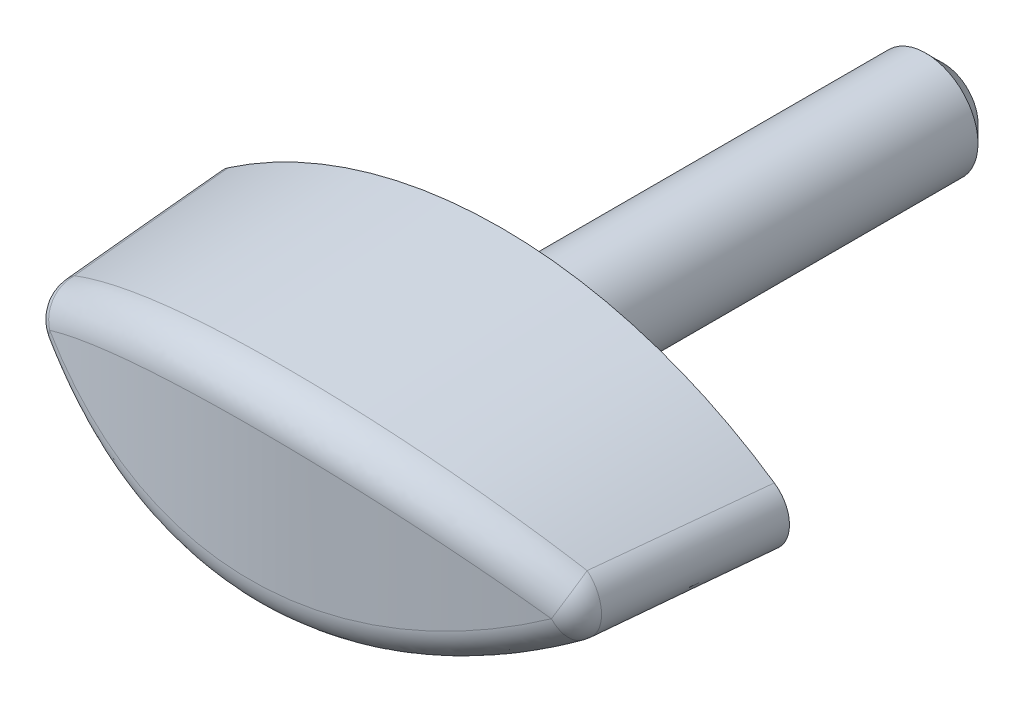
ISO-10303-21;
HEADER;
FILE_DESCRIPTION(('STEP AP214'),'2;1');
FILE_NAME('part.step','',(''),(''),'','','');
FILE_SCHEMA(('AUTOMOTIVE_DESIGN { 1 0 10303 214 1 1 1 1 }'));
ENDSEC;
DATA;
#1=APPLICATION_CONTEXT('core data for automotive mechanical design processes');
#2=APPLICATION_PROTOCOL_DEFINITION('international standard','automotive_design',2000,#1);
#3=PRODUCT_CONTEXT('',#1,'mechanical');
#4=PRODUCT('Part','Part','',(#3));
#5=PRODUCT_RELATED_PRODUCT_CATEGORY('part','',(#4));
#6=PRODUCT_DEFINITION_FORMATION('','',#4);
#7=PRODUCT_DEFINITION_CONTEXT('part definition',#1,'design');
#8=PRODUCT_DEFINITION('design','',#6,#7);
#9=PRODUCT_DEFINITION_SHAPE('','',#8);
#10=(LENGTH_UNIT() NAMED_UNIT(*) SI_UNIT(.MILLI.,.METRE.));
#11=(NAMED_UNIT(*) PLANE_ANGLE_UNIT() SI_UNIT($,.RADIAN.));
#12=(NAMED_UNIT(*) SI_UNIT($,.STERADIAN.) SOLID_ANGLE_UNIT());
#13=UNCERTAINTY_MEASURE_WITH_UNIT(LENGTH_MEASURE(1.E-05),#10,'distance_accuracy_value','');
#14=(GEOMETRIC_REPRESENTATION_CONTEXT(3) GLOBAL_UNCERTAINTY_ASSIGNED_CONTEXT((#13)) GLOBAL_UNIT_ASSIGNED_CONTEXT((#10,
#11,#12)) REPRESENTATION_CONTEXT('',''));
#15=CARTESIAN_POINT('',(0.,0.,0.));
#16=DIRECTION('',(0.,0.,1.));
#17=DIRECTION('',(1.,0.,0.));
#18=AXIS2_PLACEMENT_3D('',#15,#16,#17);
#19=CARTESIAN_POINT('',(-0.00046056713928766,-21.3,0.4));
#20=DIRECTION('',(0.,0.,-1.));
#21=DIRECTION('',(1.,0.,0.));
#22=AXIS2_PLACEMENT_3D('',#19,#20,#21);
#23=CONICAL_SURFACE('',#22,27.8,0.05235987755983);
#24=CARTESIAN_POINT('',(-0.00046056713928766,-21.3,0.4));
#25=DIRECTION('',(0.,0.,1.));
#26=DIRECTION('',(1.,0.,0.));
#27=AXIS2_PLACEMENT_3D('',#24,#25,#26);
#28=CIRCLE('',#27,27.8);
#29=CARTESIAN_POINT('',(15.6901745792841,1.6487247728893,0.4));
#30=VERTEX_POINT('',#29);
#31=CARTESIAN_POINT('',(-15.6910957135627,1.6487247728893,0.4));
#32=VERTEX_POINT('',#31);
#33=EDGE_CURVE('E235',#30,#32,#28,.T.);
#34=ORIENTED_EDGE('',*,*,#33,.T.);
#35=CARTESIAN_POINT('',(-14.153359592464,1.70103457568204,15.5404933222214));
#36=CARTESIAN_POINT('',(-15.0967597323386,1.11474020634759,15.6348374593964));
#37=CARTESIAN_POINT('',(-15.0967597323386,0.,15.6348374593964));
#38=CARTESIAN_POINT('',(-15.0967597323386,-1.11474020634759,15.6348374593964));
#39=CARTESIAN_POINT('',(-14.153359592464,-1.70103457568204,15.5404933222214));
#40=CARTESIAN_POINT('',(-14.3318556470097,1.69502029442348,13.8532547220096));
#41=CARTESIAN_POINT('',(-15.2654012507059,1.10725885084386,13.9484266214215));
#42=CARTESIAN_POINT('',(-15.2656662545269,0.,13.9457595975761));
#43=CARTESIAN_POINT('',(-15.2654012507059,-1.10725885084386,13.9484266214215));
#44=CARTESIAN_POINT('',(-14.3318556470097,-1.69502029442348,13.8532547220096));
#45=CARTESIAN_POINT('',(-14.5077422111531,1.68906895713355,12.1657858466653));
#46=CARTESIAN_POINT('',(-15.4319944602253,1.09998107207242,12.2590737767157));
#47=CARTESIAN_POINT('',(-15.4322394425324,0.,12.2565551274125));
#48=CARTESIAN_POINT('',(-15.4319944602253,-1.09998107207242,12.2590737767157));
#49=CARTESIAN_POINT('',(-14.5077422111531,-1.68906895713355,12.1657858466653));
#50=CARTESIAN_POINT('',(-14.8547932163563,1.67728860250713,8.79045641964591));
#51=CARTESIAN_POINT('',(-15.7609233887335,1.08581921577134,8.88044733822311));
#52=CARTESIAN_POINT('',(-15.7611684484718,0.,8.87793247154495));
#53=CARTESIAN_POINT('',(-15.7609233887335,-1.08581921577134,8.88044733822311));
#54=CARTESIAN_POINT('',(-14.8547932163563,-1.67728860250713,8.79045641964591));
#55=CARTESIAN_POINT('',(-15.0259577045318,1.6714595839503,7.10259587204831));
#56=CARTESIAN_POINT('',(-15.9233017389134,1.07893267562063,7.19086597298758));
#57=CARTESIAN_POINT('',(-15.9235243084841,0.,7.18851428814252));
#58=CARTESIAN_POINT('',(-15.9233017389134,-1.07893267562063,7.19086597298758));
#59=CARTESIAN_POINT('',(-15.0259577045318,-1.6714595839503,7.10259587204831));
#60=CARTESIAN_POINT('',(-15.6389500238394,1.6505385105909,0.981728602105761));
#61=CARTESIAN_POINT('',(-16.5038593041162,1.0546564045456,1.07851891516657));
#62=CARTESIAN_POINT('',(-16.5054048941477,0.,1.06226832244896));
#63=CARTESIAN_POINT('',(-16.5038593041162,-1.0546564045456,1.07851891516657));
#64=CARTESIAN_POINT('',(-15.6389500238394,-1.6505385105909,0.981728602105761));
#65=CARTESIAN_POINT('',(-16.0683322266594,1.63579618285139,-3.45232904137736));
#66=CARTESIAN_POINT('',(-16.9125731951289,1.03822558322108,-3.36118159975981));
#67=CARTESIAN_POINT('',(-16.9138312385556,0.,-3.37517244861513));
#68=CARTESIAN_POINT('',(-16.9125731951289,-1.03822558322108,-3.36118159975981));
#69=CARTESIAN_POINT('',(-16.0683322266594,-1.63579618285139,-3.45232904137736));
#70=CARTESIAN_POINT('',(-16.9043767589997,1.60706856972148,-12.3222655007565));
#71=CARTESIAN_POINT('',(-17.7092403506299,1.00727593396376,-12.2373342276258));
#72=CARTESIAN_POINT('',(-17.7104809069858,0.,-12.2511817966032));
#73=CARTESIAN_POINT('',(-17.7092403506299,-1.00727593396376,-12.2373342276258));
#74=CARTESIAN_POINT('',(-16.9043767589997,-1.60706856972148,-12.3222655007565));
#75=CARTESIAN_POINT('',(-17.3110389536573,1.59308328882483,-16.7581443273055));
#76=CARTESIAN_POINT('',(-18.0976673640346,0.99273181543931,-16.6776440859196));
#77=CARTESIAN_POINT('',(-18.0987041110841,0.,-16.6897503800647));
#78=CARTESIAN_POINT('',(-18.0976673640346,-0.99273181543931,-16.6776440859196));
#79=CARTESIAN_POINT('',(-17.3110389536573,-1.59308328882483,-16.7581443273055));
#80=CARTESIAN_POINT('',(-18.1060525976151,1.56581345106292,-25.63153463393));
#81=CARTESIAN_POINT('',(-18.8578714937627,0.965180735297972,-25.5559824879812));
#82=CARTESIAN_POINT('',(-18.8589022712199,0.,-25.5680225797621));
#83=CARTESIAN_POINT('',(-18.8578714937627,-0.965180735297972,-25.5559824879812));
#84=CARTESIAN_POINT('',(-18.1060525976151,-1.56581345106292,-25.63153463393));
#85=CARTESIAN_POINT('',(-18.4944030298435,1.55252893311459,-30.0690461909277));
#86=CARTESIAN_POINT('',(-19.2300008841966,0.952156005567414,-29.9970959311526));
#87=CARTESIAN_POINT('',(-19.2308763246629,0.,-30.0077262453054));
#88=CARTESIAN_POINT('',(-19.2300008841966,-0.952156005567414,-29.9970959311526));
#89=CARTESIAN_POINT('',(-18.4944030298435,-1.55252893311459,-30.0690461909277));
#90=CARTESIAN_POINT('',(-19.0655893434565,1.53309045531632,-36.7261060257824));
#91=CARTESIAN_POINT('',(-19.7785728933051,0.933545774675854,-36.6651612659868));
#92=CARTESIAN_POINT('',(-19.778789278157,0.,-36.6677969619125));
#93=CARTESIAN_POINT('',(-19.7785728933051,-0.933545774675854,-36.6651612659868));
#94=CARTESIAN_POINT('',(-19.0655893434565,-1.53309045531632,-36.7261060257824));
#95=CARTESIAN_POINT('',(-19.2540937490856,1.52669238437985,-38.9452441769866));
#96=CARTESIAN_POINT('',(-19.959549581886,0.927505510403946,-38.8853995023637));
#97=CARTESIAN_POINT('',(-19.9597511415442,0.,-38.8878925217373));
#98=CARTESIAN_POINT('',(-19.959549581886,-0.927505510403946,-38.8853995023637));
#99=CARTESIAN_POINT('',(-19.2540937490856,-1.52669238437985,-38.9452441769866));
#100=CARTESIAN_POINT('',(-19.6276330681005,1.51405317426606,-43.3837667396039));
#101=CARTESIAN_POINT('',(-20.3184015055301,0.915713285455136,-43.325766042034));
#102=CARTESIAN_POINT('',(-20.3186020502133,0.,-43.3282485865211));
#103=CARTESIAN_POINT('',(-20.3184015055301,-0.915713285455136,-43.325766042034));
#104=CARTESIAN_POINT('',(-19.6276330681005,-1.51405317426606,-43.3837667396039));
#105=CARTESIAN_POINT('',(-19.8126679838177,1.50781203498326,-45.6031511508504));
#106=CARTESIAN_POINT('',(-20.4963068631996,0.909959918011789,-45.5461814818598));
#107=CARTESIAN_POINT('',(-20.4964910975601,0.,-45.5485090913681));
#108=CARTESIAN_POINT('',(-20.4963068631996,-0.909959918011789,-45.5461814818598));
#109=CARTESIAN_POINT('',(-19.8126679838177,-1.50781203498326,-45.6031511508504));
#110=CARTESIAN_POINT('',(-19.9961229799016,1.50164645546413,-47.8226466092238));
#111=CARTESIAN_POINT('',(-20.6729817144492,0.904332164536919,-47.7688455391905));
#112=CARTESIAN_POINT('',(-20.6729817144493,0.,-47.7688455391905));
#113=CARTESIAN_POINT('',(-20.6729817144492,-0.904332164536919,-47.7688455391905));
#114=CARTESIAN_POINT('',(-19.9961229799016,-1.50164645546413,-47.8226466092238));
#115=(BOUNDED_SURFACE() B_SPLINE_SURFACE(3,2,((#35,#36,#37,#38,#39),(#40,#41,#42,#43,#44),(#45,
#46,#47,#48,#49),(#50,#51,#52,#53,#54),(#55,#56,#57,#58,#59),(#60,#61,#62,#63,#64),(#65,#66,#67,
#68,#69),(#70,#71,#72,#73,#74),(#75,#76,#77,#78,#79),(#80,#81,#82,#83,#84),(#85,#86,#87,#88,
#89),(#90,#91,#92,#93,#94),(#95,#96,#97,#98,#99),(#100,#101,#102,#103,#104),(#105,#106,#107,
#108,#109),(#110,#111,#112,#113,#114)),.UNSPECIFIED.,.F.,.F.,
.F.) B_SPLINE_SURFACE_WITH_KNOTS((4,2,2,2,2,2,2,4),(3,2,3),(0.,5.08695661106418,
10.1738624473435,23.5321935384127,36.8906039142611,50.2497553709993,56.9292475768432,
63.6087352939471),(0.,0.5,1.),
.UNSPECIFIED.) GEOMETRIC_REPRESENTATION_ITEM() RATIONAL_B_SPLINE_SURFACE(((1.,0.873483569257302,
1.,0.873483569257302,1.),(1.,0.874875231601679,1.,0.874875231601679,1.),(1.,0.876222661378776,
1.,0.876222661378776,1.),(1.,0.878837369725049,1.,0.878837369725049,1.),(1.,0.880104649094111,
1.,0.880104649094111,1.),(1.,0.884569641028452,1.,0.884569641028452,1.),(1.,0.887555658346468,
1.,0.887555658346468,1.),(1.,0.893140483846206,1.,0.893140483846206,1.),(1.,0.895739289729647,
1.,0.895739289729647,1.),(1.,0.90062485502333,1.,0.90062485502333,1.),(1.,0.902911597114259,1.,
0.902911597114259,1.),(1.,0.906149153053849,1.,0.906149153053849,1.),(1.,0.907196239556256,1.,
0.907196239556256,1.),(1.,0.909231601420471,1.,0.909231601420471,1.),(1.,0.9102198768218,1.,
0.9102198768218,1.),(1.,0.911181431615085,1.,0.911181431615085,1.))) REPRESENTATION_ITEM('') SURFACE());
#116=CARTESIAN_POINT('',(-19.9961229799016,1.50164645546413,-47.8226466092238));
#117=CARTESIAN_POINT('',(-19.8126679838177,1.50781203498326,-45.6031511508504));
#118=CARTESIAN_POINT('',(-19.6276330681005,1.51405317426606,-43.3837667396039));
#119=CARTESIAN_POINT('',(-19.2540937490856,1.52669238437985,-38.9452441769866));
#120=CARTESIAN_POINT('',(-19.0655893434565,1.53309045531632,-36.7261060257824));
#121=CARTESIAN_POINT('',(-18.4944030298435,1.55252893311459,-30.0690461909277));
#122=CARTESIAN_POINT('',(-18.1060525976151,1.56581345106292,-25.63153463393));
#123=CARTESIAN_POINT('',(-17.3110389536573,1.59308328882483,-16.7581443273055));
#124=CARTESIAN_POINT('',(-16.9043767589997,1.60706856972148,-12.3222655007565));
#125=CARTESIAN_POINT('',(-16.0683322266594,1.63579618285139,-3.45232904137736));
#126=CARTESIAN_POINT('',(-15.6389500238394,1.6505385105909,0.98172860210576));
#127=CARTESIAN_POINT('',(-15.0259577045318,1.6714595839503,7.10259587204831));
#128=CARTESIAN_POINT('',(-14.8547932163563,1.67728860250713,8.7904564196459));
#129=CARTESIAN_POINT('',(-14.5077422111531,1.68906895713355,12.1657858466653));
#130=CARTESIAN_POINT('',(-14.3318556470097,1.69502029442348,13.8532547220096));
#131=CARTESIAN_POINT('',(-14.153359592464,1.70103457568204,15.5404933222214));
#132=B_SPLINE_CURVE_WITH_KNOTS('',3,(#116,#117,#118,#119,#120,#121,#122,#123,#124,#125,#126,
#127,#128,#129,#130,#131),.UNSPECIFIED.,.F.,.F.,(4,2,2,2,2,2,2,4),(0.,6.67948771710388,
13.3589799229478,26.718131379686,40.0765417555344,53.4348728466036,58.5217786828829,
63.6087352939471),.UNSPECIFIED.);
#133=CARTESIAN_POINT('',(-14.7065623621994,1.6823200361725,10.2319467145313));
#134=VERTEX_POINT('',#133);
#135=EDGE_CURVE('E185',#32,#134,#132,.T.);
#136=ORIENTED_EDGE('',*,*,#135,.T.);
#137=CARTESIAN_POINT('',(-20.0811536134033,-4.41765469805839,9.05919102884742));
#138=CARTESIAN_POINT('',(-20.794375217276,-3.4970775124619,8.61347525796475));
#139=CARTESIAN_POINT('',(-20.5149823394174,-3.09184561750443,7.46781532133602));
#140=CARTESIAN_POINT('',(-19.815137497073,-4.14625680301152,9.22543510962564));
#141=CARTESIAN_POINT('',(-20.5308171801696,-3.20305312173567,8.78645329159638));
#142=CARTESIAN_POINT('',(-20.2437516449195,-2.79870414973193,7.62525685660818));
#143=CARTESIAN_POINT('',(-19.5427558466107,-3.88016952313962,9.39104448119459));
#144=CARTESIAN_POINT('',(-20.2613659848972,-2.91519162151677,8.95855393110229));
#145=CARTESIAN_POINT('',(-19.9659982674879,-2.51127069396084,7.78209729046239));
#146=CARTESIAN_POINT('',(-18.9853591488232,-3.35883373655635,9.72006316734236));
#147=CARTESIAN_POINT('',(-19.7089688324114,-2.34984852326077,9.30130522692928));
#148=CARTESIAN_POINT('',(-19.3975413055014,-1.94806022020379,8.09369459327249));
#149=CARTESIAN_POINT('',(-18.700343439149,-3.10358579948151,9.88347236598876));
#150=CARTESIAN_POINT('',(-19.4258932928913,-2.07241226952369,9.47196402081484));
#151=CARTESIAN_POINT('',(-19.1068370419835,-1.67228381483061,8.24845135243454));
#152=CARTESIAN_POINT('',(-17.8259485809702,-2.35396683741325,10.3693030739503));
#153=CARTESIAN_POINT('',(-18.5525101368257,-1.25251492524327,9.98255871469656));
#154=CARTESIAN_POINT('',(-18.214886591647,-0.862303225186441,8.70855755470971));
#155=CARTESIAN_POINT('',(-17.2177574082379,-1.8762677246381,10.6869893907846));
#156=CARTESIAN_POINT('',(-17.9443331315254,-0.729523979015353,10.3169263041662));
#157=CARTESIAN_POINT('',(-17.5943489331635,-0.346038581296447,9.00942253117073));
#158=CARTESIAN_POINT('',(-15.9491742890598,-0.965762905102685,11.3040494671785));
#159=CARTESIAN_POINT('',(-16.6701568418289,0.273374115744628,10.9703683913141));
#160=CARTESIAN_POINT('',(-16.2997263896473,0.638135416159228,9.59380956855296));
#161=CARTESIAN_POINT('',(-15.2884707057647,-0.533266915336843,11.6032917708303));
#162=CARTESIAN_POINT('',(-16.0031357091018,0.752117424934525,11.2889684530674));
#163=CARTESIAN_POINT('',(-15.6253216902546,1.1057110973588,9.87720713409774));
#164=CARTESIAN_POINT('',(-13.9208675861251,0.279150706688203,12.1737233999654));
#165=CARTESIAN_POINT('',(-14.6152521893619,1.65761638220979,11.9005576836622));
#166=CARTESIAN_POINT('',(-14.2290764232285,1.98415563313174,10.4174346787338));
#167=CARTESIAN_POINT('',(-13.2139942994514,0.659101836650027,12.4449284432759));
#168=CARTESIAN_POINT('',(-13.8940627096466,2.08328537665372,12.1929547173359));
#169=CARTESIAN_POINT('',(-13.5072628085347,2.3950563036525,10.6742795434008));
#170=CARTESIAN_POINT('',(-11.9037976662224,1.29127459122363,12.9012003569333));
#171=CARTESIAN_POINT('',(-12.5513754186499,2.79582931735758,12.6879484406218));
#172=CARTESIAN_POINT('',(-12.169137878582,3.07881265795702,11.106392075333));
#173=CARTESIAN_POINT('',(-11.3082180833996,1.55381959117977,13.092624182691));
#174=CARTESIAN_POINT('',(-11.937530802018,3.09343963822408,12.8968627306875));
#175=CARTESIAN_POINT('',(-11.5607814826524,3.36281474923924,11.2876801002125));
#176=CARTESIAN_POINT('',(-10.0920972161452,2.03992330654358,13.4495175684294));
#177=CARTESIAN_POINT('',(-10.6779261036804,3.64779713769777,13.2887861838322));
#178=CARTESIAN_POINT('',(-10.3184198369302,3.88869405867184,11.6256761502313));
#179=CARTESIAN_POINT('',(-9.47156072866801,2.26348947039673,13.6149920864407));
#180=CARTESIAN_POINT('',(-10.0325856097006,3.90376958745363,13.4712796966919));
#181=CARTESIAN_POINT('',(-9.68441951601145,4.13057932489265,11.7823888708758));
#182=CARTESIAN_POINT('',(-8.21085725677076,2.66837293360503,13.9161644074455));
#183=CARTESIAN_POINT('',(-8.71506821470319,4.37008842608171,13.8054592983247));
#184=CARTESIAN_POINT('',(-8.39623064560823,4.56867140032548,12.0676142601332));
#185=CARTESIAN_POINT('',(-7.57076855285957,2.84983870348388,14.0519667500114));
#186=CARTESIAN_POINT('',(-8.04373214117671,4.57980517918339,13.9567055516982));
#187=CARTESIAN_POINT('',(-7.74212254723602,4.76503873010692,12.1962259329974));
#188=CARTESIAN_POINT('',(-6.27276490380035,3.16913872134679,14.2916144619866));
#189=CARTESIAN_POINT('',(-6.67611405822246,4.95084987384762,14.2251405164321));
#190=CARTESIAN_POINT('',(-6.41558263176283,5.1105777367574,12.4231844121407));
#191=CARTESIAN_POINT('',(-5.6148541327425,3.30698309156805,14.3954672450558));
#192=CARTESIAN_POINT('',(-5.98095824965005,5.11144433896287,14.3418059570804));
#193=CARTESIAN_POINT('',(-5.74315510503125,5.25976036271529,12.5215382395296));
#194=CARTESIAN_POINT('',(-4.469550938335,3.50526400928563,14.5449044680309));
#195=CARTESIAN_POINT('',(-4.76699841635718,5.34334265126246,14.5103840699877));
#196=CARTESIAN_POINT('',(-4.57251302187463,5.47435769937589,12.663062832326));
#197=CARTESIAN_POINT('',(-3.98527879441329,3.57656511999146,14.5986601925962));
#198=CARTESIAN_POINT('',(-4.25248577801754,5.42691580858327,14.5711789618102));
#199=CARTESIAN_POINT('',(-4.07750634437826,5.55152868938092,12.7139722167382));
#200=CARTESIAN_POINT('',(-3.01174289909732,3.69472517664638,14.6875554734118));
#201=CARTESIAN_POINT('',(-3.21589634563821,5.56575349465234,14.6720040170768));
#202=CARTESIAN_POINT('',(-3.08236136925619,5.67941760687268,12.798160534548));
#203=CARTESIAN_POINT('',(-2.52247966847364,3.74158664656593,14.7226969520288));
#204=CARTESIAN_POINT('',(-2.69445046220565,5.62084543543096,14.7119082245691));
#205=CARTESIAN_POINT('',(-2.58222360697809,5.7301382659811,12.8314412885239));
#206=CARTESIAN_POINT('',(-1.54056281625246,3.81050009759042,14.7739283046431));
#207=CARTESIAN_POINT('',(-1.64628256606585,5.70198847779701,14.7702334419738));
#208=CARTESIAN_POINT('',(-1.57846523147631,5.80472574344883,12.8799599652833));
#209=CARTESIAN_POINT('',(-1.04790652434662,3.83252956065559,14.7900008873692));
#210=CARTESIAN_POINT('',(-1.12024397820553,5.72790625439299,14.7885569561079));
#211=CARTESIAN_POINT('',(-1.07484187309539,5.82856818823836,12.8951815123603));
#212=CARTESIAN_POINT('',(-0.0619125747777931,3.85152073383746,14.8028268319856));
#213=CARTESIAN_POINT('',(-0.0664657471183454,5.75020151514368,14.8032709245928));
#214=CARTESIAN_POINT('',(-0.0668941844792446,5.84911822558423,12.907328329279));
#215=CARTESIAN_POINT('',(0.431424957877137,3.84848655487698,14.799583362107));
#216=CARTESIAN_POINT('',(0.460560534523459,5.74655453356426,14.7996444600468));
#217=CARTESIAN_POINT('',(0.437430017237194,5.84583026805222,12.9042565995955));
#218=CARTESIAN_POINT('',(1.60255721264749,3.81150451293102,14.768936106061));
#219=CARTESIAN_POINT('',(1.71175123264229,5.70275305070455,14.7649470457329));
#220=CARTESIAN_POINT('',(1.63463358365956,5.80579033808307,12.8752321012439));
#221=CARTESIAN_POINT('',(2.27978109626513,3.76633440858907,14.7328856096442));
#222=CARTESIAN_POINT('',(2.43402260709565,5.64946733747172,14.7241316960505));
#223=CARTESIAN_POINT('',(2.32692566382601,5.75689079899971,12.8410904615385));
#224=CARTESIAN_POINT('',(3.62612133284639,3.62923557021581,14.6250252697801));
#225=CARTESIAN_POINT('',(3.86899032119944,5.48787530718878,14.6019758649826));
#226=CARTESIAN_POINT('',(3.70317371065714,5.60848345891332,12.7389412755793));
#227=CARTESIAN_POINT('',(4.295235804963,3.53729619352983,14.5532072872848));
#228=CARTESIAN_POINT('',(4.57997445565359,5.37995560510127,14.5209239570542));
#229=CARTESIAN_POINT('',(4.38712774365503,5.50896413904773,12.6709260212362));
#230=CARTESIAN_POINT('',(5.620453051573,3.30807293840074,14.3754561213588));
#231=CARTESIAN_POINT('',(5.98551056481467,5.11135398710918,14.3206149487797));
#232=CARTESIAN_POINT('',(5.74165729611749,5.26085961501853,12.5025866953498));
#233=CARTESIAN_POINT('',(6.27654930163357,3.17076690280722,14.2695062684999));
#234=CARTESIAN_POINT('',(6.67861072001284,4.95125521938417,14.2017864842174));
#235=CARTESIAN_POINT('',(6.41222610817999,5.11225043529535,12.4022468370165));
#236=CARTESIAN_POINT('',(7.57081563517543,2.85284943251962,14.0258788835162));
#237=CARTESIAN_POINT('',(8.04198725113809,4.58157504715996,13.9292868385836));
#238=CARTESIAN_POINT('',(7.73493729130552,4.76818970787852,12.1715194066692));
#239=CARTESIAN_POINT('',(8.20898646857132,2.67223981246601,13.8882026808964));
#240=CARTESIAN_POINT('',(8.71115884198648,4.37273579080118,13.7761497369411));
#241=CARTESIAN_POINT('',(8.38708043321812,4.57274012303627,12.0411330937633));
#242=CARTESIAN_POINT('',(9.45972662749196,2.27134461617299,13.5849607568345));
#243=CARTESIAN_POINT('',(10.018010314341,3.91078956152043,13.4400567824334));
#244=CARTESIAN_POINT('',(9.66507796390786,4.13894650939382,11.7539476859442));
#245=CARTESIAN_POINT('',(10.0724307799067,2.05131346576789,13.4195742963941));
#246=CARTESIAN_POINT('',(10.6550893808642,3.6587567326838,13.2578452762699));
#247=CARTESIAN_POINT('',(10.2910709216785,3.90087755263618,11.5973183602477));
#248=CARTESIAN_POINT('',(11.2734423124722,1.57331508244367,13.063501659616));
#249=CARTESIAN_POINT('',(11.8988735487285,3.11342074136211,12.8671751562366));
#250=CARTESIAN_POINT('',(11.5179880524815,3.38374983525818,11.2600996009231));
#251=CARTESIAN_POINT('',(11.861749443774,1.31534746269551,12.8728152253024));
#252=CARTESIAN_POINT('',(12.5051806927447,2.82087015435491,12.6592205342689));
#253=CARTESIAN_POINT('',(12.1189119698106,3.10469065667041,11.0795099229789));
#254=CARTESIAN_POINT('',(13.0124178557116,0.763585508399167,12.4692690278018));
#255=CARTESIAN_POINT('',(13.6860353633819,2.19779571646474,12.2210884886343));
#256=CARTESIAN_POINT('',(13.2941017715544,2.50788863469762,10.6973313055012));
#257=CARTESIAN_POINT('',(13.5747438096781,0.469744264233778,12.2563802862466));
#258=CARTESIAN_POINT('',(14.2604369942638,1.86790212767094,11.9913089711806));
#259=CARTESIAN_POINT('',(13.8683313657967,2.19009514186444,10.4957149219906));
#260=CARTESIAN_POINT('',(14.6709415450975,-0.151187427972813,11.8121448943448));
#261=CARTESIAN_POINT('',(15.3754021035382,1.17378101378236,11.5140037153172));
#262=CARTESIAN_POINT('',(14.9875696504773,1.51863734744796,10.0750015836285));
#263=CARTESIAN_POINT('',(15.2048097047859,-0.478282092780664,11.5807959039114));
#264=CARTESIAN_POINT('',(15.9160811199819,0.810131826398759,11.2668068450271));
#265=CARTESIAN_POINT('',(15.5325746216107,1.16496849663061,9.85590241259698));
#266=CARTESIAN_POINT('',(16.3010347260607,-1.2020925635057,11.076437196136));
#267=CARTESIAN_POINT('',(17.0209453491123,0.0093402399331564,10.7306608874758));
#268=CARTESIAN_POINT('',(16.6514893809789,0.38246399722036,9.37824925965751));
#269=CARTESIAN_POINT('',(16.859863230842,-1.60250195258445,10.8016660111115));
#270=CARTESIAN_POINT('',(17.5821760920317,-0.431467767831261,10.4400241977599));
#271=CARTESIAN_POINT('',(17.2217772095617,-0.0503529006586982,9.11802707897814));
#272=CARTESIAN_POINT('',(17.93940530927,-2.43944703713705,10.2387860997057));
#273=CARTESIAN_POINT('',(18.6616083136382,-1.34884391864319,9.84744151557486));
#274=CARTESIAN_POINT('',(18.3232481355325,-0.954885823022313,8.58495139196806));
#275=CARTESIAN_POINT('',(18.4601120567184,-2.87598917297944,9.95067499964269));
#276=CARTESIAN_POINT('',(19.1803900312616,-1.82496232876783,9.54563233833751));
#277=CARTESIAN_POINT('',(18.8544242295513,-1.42660878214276,8.31209563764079));
#278=CARTESIAN_POINT('',(19.4601451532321,-3.78132024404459,9.36761594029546));
#279=CARTESIAN_POINT('',(20.172691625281,-2.80841975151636,8.93752577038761));
#280=CARTESIAN_POINT('',(19.8743614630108,-2.40473038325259,7.75990928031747));
#281=CARTESIAN_POINT('',(19.9396415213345,-4.24996077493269,9.07270313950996));
#282=CARTESIAN_POINT('',(20.647062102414,-3.31530887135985,8.63125476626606));
#283=CARTESIAN_POINT('',(20.3632969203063,-2.91096939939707,7.4806119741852));
#284=CARTESIAN_POINT('',(20.6287720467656,-4.97711707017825,8.62854705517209));
#285=CARTESIAN_POINT('',(21.3283507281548,-4.10131871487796,8.17047222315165));
#286=CARTESIAN_POINT('',(21.0658500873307,-3.69632587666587,7.05997374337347));
#287=CARTESIAN_POINT('',(20.8534327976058,-5.22349757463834,8.48021886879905));
#288=CARTESIAN_POINT('',(21.5494719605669,-4.36633664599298,8.01734695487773));
#289=CARTESIAN_POINT('',(21.2948618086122,-3.96240386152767,6.91949946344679));
#290=CARTESIAN_POINT('',(21.2926427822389,-5.7242705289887,8.18366278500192));
#291=CARTESIAN_POINT('',(21.9810585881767,-4.90404357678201,7.71178627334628));
#292=CARTESIAN_POINT('',(21.7425310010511,-4.50316520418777,6.63864588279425));
#293=CARTESIAN_POINT('',(21.507191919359,-5.97866305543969,8.03543488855));
#294=CARTESIAN_POINT('',(22.1916197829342,-5.17672868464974,7.55932336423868));
#295=CARTESIAN_POINT('',(21.9611883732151,-4.77784864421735,6.49826658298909));
#296=CARTESIAN_POINT('',(21.7166323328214,-6.23702325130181,7.887613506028));
#297=CARTESIAN_POINT('',(22.3974453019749,-5.45401421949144,7.40710811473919));
#298=CARTESIAN_POINT('',(22.1746166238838,-5.05679182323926,6.35827227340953));
#299=(BOUNDED_SURFACE() B_SPLINE_SURFACE(3,2,((#137,#138,#139),(#140,#141,#142),(#143,#144,
#145),(#146,#147,#148),(#149,#150,#151),(#152,#153,#154),(#155,#156,#157),(#158,#159,#160),
(#161,#162,#163),(#164,#165,#166),(#167,#168,#169),(#170,#171,#172),(#173,#174,#175),(#176,#177,
#178),(#179,#180,#181),(#182,#183,#184),(#185,#186,#187),(#188,#189,#190),(#191,#192,#193),
(#194,#195,#196),(#197,#198,#199),(#200,#201,#202),(#203,#204,#205),(#206,#207,#208),(#209,#210,
#211),(#212,#213,#214),(#215,#216,#217),(#218,#219,#220),(#221,#222,#223),(#224,#225,#226),
(#227,#228,#229),(#230,#231,#232),(#233,#234,#235),(#236,#237,#238),(#239,#240,#241),(#242,#243,
#244),(#245,#246,#247),(#248,#249,#250),(#251,#252,#253),(#254,#255,#256),(#257,#258,#259),
(#260,#261,#262),(#263,#264,#265),(#266,#267,#268),(#269,#270,#271),(#272,#273,#274),(#275,#276,
#277),(#278,#279,#280),(#281,#282,#283),(#284,#285,#286),(#287,#288,#289),(#290,#291,#292),
(#293,#294,#295),(#296,#297,#298)),.UNSPECIFIED.,.F.,.F.,.F.) B_SPLINE_SURFACE_WITH_KNOTS((4,2,
2,2,2,2,2,2,2,2,2,2,2,2,2,2,2,2,2,2,2,2,2,2,2,2,4),(3,3),(0.,1.20698527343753,2.41403389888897,
4.8305598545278,7.26268570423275,9.6934406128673,11.6356284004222,13.5774446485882,
15.5123051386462,17.4467163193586,18.8465647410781,20.2462685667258,21.6472406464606,
23.0479829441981,24.9767574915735,26.9059711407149,28.8361284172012,30.7662048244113,
32.6842460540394,34.6023068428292,36.522903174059,38.4437433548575,40.580186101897,
42.7170104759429,44.844547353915,45.9080071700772,46.9714771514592),(0.,1.),
.UNSPECIFIED.) GEOMETRIC_REPRESENTATION_ITEM() RATIONAL_B_SPLINE_SURFACE(((1.,0.848585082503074,
1.),(1.,0.845596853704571,1.),(1.,0.842576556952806,1.),(1.,0.836489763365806,1.),(1.,
0.833423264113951,1.),(1.,0.82417564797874,1.),(1.,0.817952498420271,1.),(1.,0.805532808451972,
1.),(1.,0.79933669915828,1.),(1.,0.787223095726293,1.),(1.,0.781305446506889,1.),(1.,
0.771122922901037,1.),(1.,0.766764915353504,1.),(1.,0.758508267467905,1.),(1.,0.754609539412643,
1.),(1.,0.747416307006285,1.),(1.,0.744119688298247,1.),(1.,0.738238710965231,1.),(1.,
0.735654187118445,1.),(1.,0.731904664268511,1.),(1.,0.730544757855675,1.),(1.,0.728284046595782,
1.),(1.,0.727383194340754,1.),(1.,0.72606162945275,1.),(1.,0.72564135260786,1.),(1.,
0.725292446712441,1.),(1.,0.725363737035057,1.),(1.,0.726116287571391,1.),(1.,0.727017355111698,
1.),(1.,0.729709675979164,1.),(1.,0.731501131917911,1.),(1.,0.735896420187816,1.),(1.,
0.738500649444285,1.),(1.,0.74441421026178,1.),(1.,0.747723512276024,1.),(1.,0.754900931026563,
1.),(1.,0.75876543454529,1.),(1.,0.766940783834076,1.),(1.,0.771251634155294,1.),(1.,
0.780199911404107,1.),(1.,0.784837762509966,1.),(1.,0.794317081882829,1.),(1.,0.799158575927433,
1.),(1.,0.809486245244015,1.),(1.,0.814983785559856,1.),(1.,0.825966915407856,1.),(1.,
0.831452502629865,1.),(1.,0.842274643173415,1.),(1.,0.847611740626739,1.),(1.,0.855448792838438,
1.),(1.,0.858032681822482,1.),(1.,0.863134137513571,1.),(1.,0.865651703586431,1.),(1.,
0.868130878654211,1.))) REPRESENTATION_ITEM('') SURFACE());
#300=CARTESIAN_POINT('',(-20.5149823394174,-3.09184561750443,7.46781532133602));
#301=CARTESIAN_POINT('',(-20.2437516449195,-2.79870414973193,7.62525685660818));
#302=CARTESIAN_POINT('',(-19.9659982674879,-2.51127069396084,7.78209729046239));
#303=CARTESIAN_POINT('',(-19.3975413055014,-1.94806022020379,8.09369459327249));
#304=CARTESIAN_POINT('',(-19.1068370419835,-1.67228381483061,8.24845135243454));
#305=CARTESIAN_POINT('',(-18.214886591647,-0.862303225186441,8.70855755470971));
#306=CARTESIAN_POINT('',(-17.5943489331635,-0.346038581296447,9.00942253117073));
#307=CARTESIAN_POINT('',(-16.2997263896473,0.638135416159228,9.59380956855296));
#308=CARTESIAN_POINT('',(-15.6253216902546,1.1057110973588,9.87720713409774));
#309=CARTESIAN_POINT('',(-14.2290764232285,1.98415563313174,10.4174346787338));
#310=CARTESIAN_POINT('',(-13.5072628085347,2.3950563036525,10.6742795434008));
#311=CARTESIAN_POINT('',(-12.169137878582,3.07881265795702,11.106392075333));
#312=CARTESIAN_POINT('',(-11.5607814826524,3.36281474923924,11.2876801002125));
#313=CARTESIAN_POINT('',(-10.3184198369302,3.88869405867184,11.6256761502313));
#314=CARTESIAN_POINT('',(-9.68441951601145,4.13057932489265,11.7823888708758));
#315=CARTESIAN_POINT('',(-8.39623064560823,4.56867140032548,12.0676142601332));
#316=CARTESIAN_POINT('',(-7.74212254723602,4.76503873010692,12.1962259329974));
#317=CARTESIAN_POINT('',(-6.41558263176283,5.1105777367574,12.4231844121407));
#318=CARTESIAN_POINT('',(-5.74315510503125,5.25976036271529,12.5215382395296));
#319=CARTESIAN_POINT('',(-4.57251302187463,5.47435769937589,12.663062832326));
#320=CARTESIAN_POINT('',(-4.07750634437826,5.55152868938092,12.7139722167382));
#321=CARTESIAN_POINT('',(-3.08236136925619,5.67941760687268,12.798160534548));
#322=CARTESIAN_POINT('',(-2.58222360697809,5.7301382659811,12.8314412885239));
#323=CARTESIAN_POINT('',(-1.57846523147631,5.80472574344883,12.8799599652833));
#324=CARTESIAN_POINT('',(-1.07484187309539,5.82856818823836,12.8951815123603));
#325=CARTESIAN_POINT('',(-0.0668941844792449,5.84911822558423,12.907328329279));
#326=CARTESIAN_POINT('',(0.437430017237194,5.84583026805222,12.9042565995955));
#327=CARTESIAN_POINT('',(1.63463358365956,5.80579033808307,12.8752321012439));
#328=CARTESIAN_POINT('',(2.32692566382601,5.75689079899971,12.8410904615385));
#329=CARTESIAN_POINT('',(3.70317371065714,5.60848345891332,12.7389412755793));
#330=CARTESIAN_POINT('',(4.38712774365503,5.50896413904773,12.6709260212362));
#331=CARTESIAN_POINT('',(5.74165729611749,5.26085961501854,12.5025866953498));
#332=CARTESIAN_POINT('',(6.41222610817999,5.11225043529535,12.4022468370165));
#333=CARTESIAN_POINT('',(7.73493729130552,4.76818970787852,12.1715194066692));
#334=CARTESIAN_POINT('',(8.38708043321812,4.57274012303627,12.0411330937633));
#335=CARTESIAN_POINT('',(9.66507796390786,4.13894650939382,11.7539476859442));
#336=CARTESIAN_POINT('',(10.2910709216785,3.90087755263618,11.5973183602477));
#337=CARTESIAN_POINT('',(11.5179880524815,3.38374983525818,11.2600996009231));
#338=CARTESIAN_POINT('',(12.1189119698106,3.10469065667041,11.0795099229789));
#339=CARTESIAN_POINT('',(13.2941017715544,2.50788863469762,10.6973313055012));
#340=CARTESIAN_POINT('',(13.8683313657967,2.19009514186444,10.4957149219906));
#341=CARTESIAN_POINT('',(14.9875696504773,1.51863734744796,10.0750015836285));
#342=CARTESIAN_POINT('',(15.5325746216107,1.16496849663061,9.85590241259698));
#343=CARTESIAN_POINT('',(16.6514893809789,0.382463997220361,9.3782492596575));
#344=CARTESIAN_POINT('',(17.2217772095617,-0.0503529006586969,9.11802707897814));
#345=CARTESIAN_POINT('',(18.3232481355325,-0.954885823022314,8.58495139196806));
#346=CARTESIAN_POINT('',(18.8544242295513,-1.42660878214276,8.31209563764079));
#347=CARTESIAN_POINT('',(19.8743614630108,-2.40473038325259,7.75990928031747));
#348=CARTESIAN_POINT('',(20.3632969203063,-2.91096939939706,7.4806119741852));
#349=CARTESIAN_POINT('',(21.0658500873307,-3.69632587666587,7.05997374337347));
#350=CARTESIAN_POINT('',(21.2948618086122,-3.96240386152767,6.91949946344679));
#351=CARTESIAN_POINT('',(21.7425310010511,-4.50316520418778,6.63864588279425));
#352=CARTESIAN_POINT('',(21.9611883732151,-4.77784864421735,6.49826658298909));
#353=CARTESIAN_POINT('',(22.1746166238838,-5.05679182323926,6.35827227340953));
#354=B_SPLINE_CURVE_WITH_KNOTS('',3,(#300,#301,#302,#303,#304,#305,#306,#307,#308,#309,#310,
#311,#312,#313,#314,#315,#316,#317,#318,#319,#320,#321,#322,#323,#324,#325,#326,#327,#328,#329,
#330,#331,#332,#333,#334,#335,#336,#337,#338,#339,#340,#341,#342,#343,#344,#345,#346,#347,#348,
#349,#350,#351,#352,#353),.UNSPECIFIED.,.F.,.F.,(4,2,2,2,2,2,2,2,2,2,2,2,2,2,2,2,2,2,2,2,2,2,2,
2,2,2,4),(0.,1.20698527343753,2.41403389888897,4.8305598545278,7.26268570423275,9.6934406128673,
11.6356284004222,13.5774446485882,15.5123051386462,17.4467163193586,18.8465647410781,
20.2462685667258,21.6472406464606,23.0479829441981,24.9767574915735,26.9059711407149,
28.8361284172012,30.7662048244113,32.6842460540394,34.6023068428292,36.522903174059,
38.4437433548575,40.580186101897,42.7170104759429,44.844547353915,45.9080071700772,
46.9714771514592),.UNSPECIFIED.);
#355=CARTESIAN_POINT('',(14.7112145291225,1.68213078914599,10.1776618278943));
#356=VERTEX_POINT('',#355);
#357=EDGE_CURVE('E72',#134,#356,#354,.T.);
#358=ORIENTED_EDGE('',*,*,#357,.T.);
#359=CARTESIAN_POINT('',(14.1562950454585,-1.70090463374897,15.5040368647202));
#360=CARTESIAN_POINT('',(15.0994880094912,-1.11457832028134,15.5983412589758));
#361=CARTESIAN_POINT('',(15.0994880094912,0.,15.5983412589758));
#362=CARTESIAN_POINT('',(15.0994880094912,1.11457832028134,15.5983412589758));
#363=CARTESIAN_POINT('',(14.1562950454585,1.70090463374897,15.5040368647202));
#364=CARTESIAN_POINT('',(14.3346959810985,-1.69489318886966,13.8173363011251));
#365=CARTESIAN_POINT('',(15.2680418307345,-1.10710248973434,13.9124675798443));
#366=CARTESIAN_POINT('',(15.2683064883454,0.,13.9098035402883));
#367=CARTESIAN_POINT('',(15.2680418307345,1.10710248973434,13.9124675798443));
#368=CARTESIAN_POINT('',(14.3346959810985,1.69489318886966,13.8173363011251));
#369=CARTESIAN_POINT('',(14.5104911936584,-1.68894463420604,12.1304058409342));
#370=CARTESIAN_POINT('',(15.4345503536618,-1.09982994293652,12.22365530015));
#371=CARTESIAN_POINT('',(15.4347950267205,0.,12.2211393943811));
#372=CARTESIAN_POINT('',(15.4345503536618,1.09982994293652,12.22365530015));
#373=CARTESIAN_POINT('',(14.5104911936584,1.68894463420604,12.1304058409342));
#374=CARTESIAN_POINT('',(14.8573660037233,-1.67716974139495,8.75615384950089));
#375=CARTESIAN_POINT('',(15.7633158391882,-1.08567800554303,8.84610978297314));
#376=CARTESIAN_POINT('',(15.7635605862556,0.,8.84359767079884));
#377=CARTESIAN_POINT('',(15.7633158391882,1.08567800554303,8.84610978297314));
#378=CARTESIAN_POINT('',(14.8573660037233,1.67716974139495,8.75615384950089));
#379=CARTESIAN_POINT('',(15.0284456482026,-1.67134340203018,7.06883232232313));
#380=CARTESIAN_POINT('',(15.9256153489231,-1.07879615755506,7.15706930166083));
#381=CARTESIAN_POINT('',(15.9258376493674,0.,7.15472009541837));
#382=CARTESIAN_POINT('',(15.9256153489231,1.07879615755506,7.15706930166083));
#383=CARTESIAN_POINT('',(15.0284456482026,1.67134340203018,7.06883232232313));
#384=CARTESIAN_POINT('',(15.6412826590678,-1.65042700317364,0.948498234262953));
#385=CARTESIAN_POINT('',(16.5060318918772,-1.05453037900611,1.04525528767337));
#386=CARTESIAN_POINT('',(16.5075766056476,0.,1.02901136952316));
#387=CARTESIAN_POINT('',(16.5060318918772,1.05453037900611,1.04525528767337));
#388=CARTESIAN_POINT('',(15.6412826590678,1.65042700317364,0.948498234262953));
#389=CARTESIAN_POINT('',(16.0706012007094,-1.63568664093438,-3.48556450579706));
#390=CARTESIAN_POINT('',(16.914688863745,-1.03810484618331,-3.39444681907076));
#391=CARTESIAN_POINT('',(16.9159462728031,0.,-3.40843243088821));
#392=CARTESIAN_POINT('',(16.914688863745,1.03810484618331,-3.39444681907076));
#393=CARTESIAN_POINT('',(16.0706012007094,1.63568664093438,-3.48556450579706));
#394=CARTESIAN_POINT('',(16.9065313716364,-1.60696281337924,-12.3555098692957));
#395=CARTESIAN_POINT('',(17.7112542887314,-1.00716466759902,-12.2706047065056));
#396=CARTESIAN_POINT('',(17.7124942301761,0.,-12.2844471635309));
#397=CARTESIAN_POINT('',(17.7112542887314,1.00716466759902,-12.2706047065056));
#398=CARTESIAN_POINT('',(16.9065313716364,1.60696281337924,-12.3555098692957));
#399=CARTESIAN_POINT('',(17.3131428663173,-1.5929793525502,-16.7913925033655));
#400=CARTESIAN_POINT('',(18.0996361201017,-0.992624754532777,-16.7109159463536));
#401=CARTESIAN_POINT('',(18.1006724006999,0.,-16.7230181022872));
#402=CARTESIAN_POINT('',(18.0996361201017,0.992624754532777,-16.7109159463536));
#403=CARTESIAN_POINT('',(17.3131428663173,1.5929793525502,-16.7913925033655));
#404=CARTESIAN_POINT('',(18.1080644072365,-1.56571302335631,-25.6647892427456));
#405=CARTESIAN_POINT('',(18.859758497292,-0.965081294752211,-25.5892582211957));
#406=CARTESIAN_POINT('',(18.8607888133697,0.,-25.6012942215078));
#407=CARTESIAN_POINT('',(18.859758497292,0.965081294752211,-25.5892582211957));
#408=CARTESIAN_POINT('',(18.1080644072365,1.56571302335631,-25.6647892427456));
#409=CARTESIAN_POINT('',(18.4963734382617,-1.55243019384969,-30.1023034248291));
#410=CARTESIAN_POINT('',(19.2318510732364,-0.952059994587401,-30.0303725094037));
#411=CARTESIAN_POINT('',(19.2327261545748,0.,-30.0409994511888));
#412=CARTESIAN_POINT('',(19.2318510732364,0.952059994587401,-30.0303725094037));
#413=CARTESIAN_POINT('',(18.4963734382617,1.55243019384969,-30.1023034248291));
#414=CARTESIAN_POINT('',(19.0675028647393,-1.53299415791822,-36.7593667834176));
#415=CARTESIAN_POINT('',(19.7803723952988,-0.93345448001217,-36.6984374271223));
#416=CARTESIAN_POINT('',(19.7805886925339,0.,-36.7010722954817));
#417=CARTESIAN_POINT('',(19.7803723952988,0.93345448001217,-36.6984374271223));
#418=CARTESIAN_POINT('',(19.0675028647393,1.53299415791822,-36.7593667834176));
#419=CARTESIAN_POINT('',(19.2559891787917,-1.52659688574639,-38.9785060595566));
#420=CARTESIAN_POINT('',(19.9613330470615,-0.927415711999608,-38.9186762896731));
#421=CARTESIAN_POINT('',(19.961534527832,0.,-38.9211685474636));
#422=CARTESIAN_POINT('',(19.9613330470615,0.927415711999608,-38.9186762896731));
#423=CARTESIAN_POINT('',(19.2559891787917,1.52659688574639,-38.9785060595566));
#424=CARTESIAN_POINT('',(19.6294938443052,-1.51395924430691,-43.4170307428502));
#425=CARTESIAN_POINT('',(20.3201542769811,-0.915626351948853,-43.3590441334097));
#426=CARTESIAN_POINT('',(20.3203547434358,0.,-43.3615259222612));
#427=CARTESIAN_POINT('',(20.3201542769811,0.915626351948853,-43.3590441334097));
#428=CARTESIAN_POINT('',(19.6294938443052,1.51395924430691,-43.4170307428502));
#429=CARTESIAN_POINT('',(19.814512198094,-1.50771887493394,-45.6364161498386));
#430=CARTESIAN_POINT('',(20.4980449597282,-0.909874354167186,-45.5794601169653));
#431=CARTESIAN_POINT('',(20.498229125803,0.,-45.5817870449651));
#432=CARTESIAN_POINT('',(20.4980449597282,0.909874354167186,-45.5794601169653));
#433=CARTESIAN_POINT('',(19.814512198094,1.50771887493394,-45.6364161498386));
#434=CARTESIAN_POINT('',(19.9979512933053,-1.50155405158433,-47.8559125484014));
#435=CARTESIAN_POINT('',(20.6747056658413,-0.904247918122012,-47.8021240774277));
#436=CARTESIAN_POINT('',(20.6747056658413,0.,-47.8021240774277));
#437=CARTESIAN_POINT('',(20.6747056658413,0.904247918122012,-47.8021240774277));
#438=CARTESIAN_POINT('',(19.9979512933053,1.50155405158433,-47.8559125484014));
#439=(BOUNDED_SURFACE() B_SPLINE_SURFACE(3,2,((#359,#360,#361,#362,#363),(#364,#365,#366,#367,
#368),(#369,#370,#371,#372,#373),(#374,#375,#376,#377,#378),(#379,#380,#381,#382,#383),(#384,
#385,#386,#387,#388),(#389,#390,#391,#392,#393),(#394,#395,#396,#397,#398),(#399,#400,#401,#402,
#403),(#404,#405,#406,#407,#408),(#409,#410,#411,#412,#413),(#414,#415,#416,#417,#418),(#419,
#420,#421,#422,#423),(#424,#425,#426,#427,#428),(#429,#430,#431,#432,#433),(#434,#435,#436,#437,
#438)),.UNSPECIFIED.,.F.,.F.,.F.) B_SPLINE_SURFACE_WITH_KNOTS((4,2,2,2,2,2,2,4),(3,2,3),(0.,
5.08532431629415,10.1705979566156,23.528928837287,36.8873388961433,50.2464890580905,
56.9259807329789,63.605467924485),(0.,0.5,1.),
.UNSPECIFIED.) GEOMETRIC_REPRESENTATION_ITEM() RATIONAL_B_SPLINE_SURFACE(((1.,0.873513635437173,
1.,0.873513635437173,1.),(1.,0.874904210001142,1.,0.874904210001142,1.),(1.,0.876250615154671,
1.,0.876250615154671,1.),(1.,0.878863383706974,1.,0.878863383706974,1.),(1.,0.880129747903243,
1.,0.880129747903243,1.),(1.,0.884592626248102,1.,0.884592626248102,1.),(1.,0.887577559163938,
1.,0.887577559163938,1.),(1.,0.893160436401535,1.,0.893160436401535,1.),(1.,0.895758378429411,
1.,0.895758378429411,1.),(1.,0.90064237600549,1.,0.90064237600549,1.),(1.,0.902928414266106,1.,
0.902928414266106,1.),(1.,0.906165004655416,1.,0.906165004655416,1.),(1.,0.907211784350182,1.,
0.907211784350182,1.),(1.,0.90924655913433,1.,0.90924655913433,1.),(1.,0.910234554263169,1.,
0.910234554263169,1.),(1.,0.911195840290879,1.,0.911195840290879,1.))) REPRESENTATION_ITEM('') SURFACE());
#440=CARTESIAN_POINT('',(14.1562950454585,1.70090463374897,15.5040368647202));
#441=CARTESIAN_POINT('',(14.3346959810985,1.69489318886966,13.8173363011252));
#442=CARTESIAN_POINT('',(14.5104911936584,1.68894463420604,12.1304058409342));
#443=CARTESIAN_POINT('',(14.8573660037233,1.67716974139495,8.75615384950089));
#444=CARTESIAN_POINT('',(15.0284456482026,1.67134340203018,7.06883232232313));
#445=CARTESIAN_POINT('',(15.6412826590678,1.65042700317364,0.948498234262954));
#446=CARTESIAN_POINT('',(16.0706012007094,1.63568664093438,-3.48556450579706));
#447=CARTESIAN_POINT('',(16.9065313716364,1.60696281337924,-12.3555098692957));
#448=CARTESIAN_POINT('',(17.3131428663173,1.5929793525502,-16.7913925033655));
#449=CARTESIAN_POINT('',(18.1080644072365,1.56571302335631,-25.6647892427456));
#450=CARTESIAN_POINT('',(18.4963734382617,1.55243019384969,-30.1023034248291));
#451=CARTESIAN_POINT('',(19.0675028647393,1.53299415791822,-36.7593667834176));
#452=CARTESIAN_POINT('',(19.2559891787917,1.52659688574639,-38.9785060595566));
#453=CARTESIAN_POINT('',(19.6294938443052,1.51395924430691,-43.4170307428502));
#454=CARTESIAN_POINT('',(19.814512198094,1.50771887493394,-45.6364161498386));
#455=CARTESIAN_POINT('',(19.9979512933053,1.50155405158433,-47.8559125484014));
#456=B_SPLINE_CURVE_WITH_KNOTS('',3,(#440,#441,#442,#443,#444,#445,#446,#447,#448,#449,#450,
#451,#452,#453,#454,#455),.UNSPECIFIED.,.F.,.F.,(4,2,2,2,2,2,2,4),(0.,5.08532431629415,
10.1705979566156,23.528928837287,36.8873388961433,50.2464890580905,56.9259807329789,
63.605467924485),.UNSPECIFIED.);
#457=EDGE_CURVE('E95',#356,#30,#456,.T.);
#458=ORIENTED_EDGE('',*,*,#457,.T.);
#459=EDGE_LOOP('',(#34,#136,#358,#458));
#460=FACE_BOUND('',#459,.T.);
#461=ADVANCED_FACE('F14',(#460),#23,.T.);
#462=CARTESIAN_POINT('',(-0.00046056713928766,21.3,0.4));
#463=DIRECTION('',(0.,0.,-1.));
#464=DIRECTION('',(1.,0.,0.));
#465=AXIS2_PLACEMENT_3D('',#462,#463,#464);
#466=CONICAL_SURFACE('',#465,27.8,0.05235987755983);
#467=CARTESIAN_POINT('',(20.0711763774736,4.39496545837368,8.98554703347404));
#468=CARTESIAN_POINT('',(20.7792479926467,3.47446072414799,8.53942960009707));
#469=CARTESIAN_POINT('',(20.4973770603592,3.06756531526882,7.39807074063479));
#470=CARTESIAN_POINT('',(19.8044221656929,4.12351179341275,9.15361619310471));
#471=CARTESIAN_POINT('',(20.5150075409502,3.18036844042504,8.71420532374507));
#472=CARTESIAN_POINT('',(20.2254000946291,2.77436157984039,7.55724071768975));
#473=CARTESIAN_POINT('',(19.5312877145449,3.85738367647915,9.32103468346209));
#474=CARTESIAN_POINT('',(20.2448645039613,2.89245643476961,8.88808179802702));
#475=CARTESIAN_POINT('',(19.9468851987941,2.48688170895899,7.71579447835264));
#476=CARTESIAN_POINT('',(18.9723520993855,3.33599641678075,9.65363716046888));
#477=CARTESIAN_POINT('',(19.6910503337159,2.32703868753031,9.23435637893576));
#478=CARTESIAN_POINT('',(19.3768706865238,1.92361052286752,8.03078581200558));
#479=CARTESIAN_POINT('',(18.6865502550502,3.08073785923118,9.81882102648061));
#480=CARTESIAN_POINT('',(19.4072487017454,2.04957856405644,9.40676269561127));
#481=CARTESIAN_POINT('',(19.0853703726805,1.64781983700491,8.18722327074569));
#482=CARTESIAN_POINT('',(17.8097315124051,2.33112606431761,10.309928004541));
#483=CARTESIAN_POINT('',(18.5315995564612,1.22963003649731,9.92258907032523));
#484=CARTESIAN_POINT('',(18.1909641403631,0.837837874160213,8.65232636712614));
#485=CARTESIAN_POINT('',(17.1998469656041,1.85349242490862,10.6310591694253));
#486=CARTESIAN_POINT('',(17.9218405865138,0.706667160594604,10.2603668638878));
#487=CARTESIAN_POINT('',(17.5687091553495,0.321636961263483,8.95645378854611));
#488=CARTESIAN_POINT('',(15.9276647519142,0.943244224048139,11.2548675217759));
#489=CARTESIAN_POINT('',(16.6442758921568,-0.296070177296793,10.9205218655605));
#490=CARTESIAN_POINT('',(16.2704328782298,-0.662275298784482,9.5472317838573));
#491=CARTESIAN_POINT('',(15.2650518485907,0.510942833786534,11.5574110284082));
#492=CARTESIAN_POINT('',(15.9754380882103,-0.774672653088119,11.2424185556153));
#493=CARTESIAN_POINT('',(15.59408806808,-1.12964925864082,9.83375575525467));
#494=CARTESIAN_POINT('',(13.8934462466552,-0.300890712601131,12.1342282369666));
#495=CARTESIAN_POINT('',(14.5837091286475,-1.67970988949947,11.860420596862));
#496=CARTESIAN_POINT('',(14.1937723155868,-2.00748082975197,10.3800307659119));
#497=CARTESIAN_POINT('',(13.1844802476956,-0.680452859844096,12.4085179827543));
#498=CARTESIAN_POINT('',(13.8604861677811,-2.10505205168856,12.1559271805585));
#499=CARTESIAN_POINT('',(13.4698287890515,-2.41797078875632,10.6397969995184));
#500=CARTESIAN_POINT('',(11.8717740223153,-1.31102657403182,12.8696160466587));
#501=CARTESIAN_POINT('',(12.5154209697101,-2.81601362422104,12.6557631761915));
#502=CARTESIAN_POINT('',(12.1291518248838,-3.10001637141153,11.0764801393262));
#503=CARTESIAN_POINT('',(11.2758775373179,-1.57249409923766,13.0628813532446));
#504=CARTESIAN_POINT('',(11.9013231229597,-3.1125135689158,12.8665158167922));
#505=CARTESIAN_POINT('',(11.5204762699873,-3.3828614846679,11.2595121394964));
#506=CARTESIAN_POINT('',(10.0591290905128,-2.05645798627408,13.4234153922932));
#507=CARTESIAN_POINT('',(10.6412133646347,-3.66467051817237,13.2620914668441));
#508=CARTESIAN_POINT('',(10.277481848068,-3.9064433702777,11.6009560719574));
#509=CARTESIAN_POINT('',(9.43828195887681,-2.27896184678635,13.5906891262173));
#510=CARTESIAN_POINT('',(9.9956198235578,-3.91955361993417,13.446395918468));
#511=CARTESIAN_POINT('',(9.64316794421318,-4.14718824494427,11.7593727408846));
#512=CARTESIAN_POINT('',(8.17697143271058,-2.6817246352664,13.8954120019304));
#513=CARTESIAN_POINT('',(8.67760217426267,-4.38370136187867,13.7841670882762));
#514=CARTESIAN_POINT('',(8.35436561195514,-4.5830039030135,12.0479606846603));
#515=CARTESIAN_POINT('',(7.53658682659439,-2.8621329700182,14.0329664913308));
#516=CARTESIAN_POINT('',(8.00601824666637,-4.59233816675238,13.9371911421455));
#517=CARTESIAN_POINT('',(7.69995815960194,-4.77823621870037,12.178231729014));
#518=CARTESIAN_POINT('',(6.23798656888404,-3.17931342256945,14.2760838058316));
#519=CARTESIAN_POINT('',(6.63788624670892,-4.96122103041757,14.2091639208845));
#520=CARTESIAN_POINT('',(6.37281380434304,-5.12150022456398,12.4084760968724));
#521=CARTESIAN_POINT('',(5.57977513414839,-3.31609576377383,14.3816541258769));
#522=CARTESIAN_POINT('',(5.94246370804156,-5.12073444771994,14.3275849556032));
#523=CARTESIAN_POINT('',(5.70008123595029,-5.26954297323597,12.5084565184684));
#524=CARTESIAN_POINT('',(4.4356763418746,-3.51223605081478,14.5337924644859));
#525=CARTESIAN_POINT('',(4.72986968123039,-5.35040739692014,14.4989082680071));
#526=CARTESIAN_POINT('',(4.53067341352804,-5.48184001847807,12.6525392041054));
#527=CARTESIAN_POINT('',(3.95293516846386,-3.58254806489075,14.5886044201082));
#528=CARTESIAN_POINT('',(4.21701264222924,-5.43294117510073,14.5607718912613));
#529=CARTESIAN_POINT('',(4.03723285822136,-5.55794742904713,12.7044488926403));
#530=CARTESIAN_POINT('',(2.98248649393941,-3.69889418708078,14.6797301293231));
#531=CARTESIAN_POINT('',(3.18376751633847,-5.56989156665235,14.6638731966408));
#532=CARTESIAN_POINT('',(3.04524572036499,-5.68388699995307,12.790749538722));
#533=CARTESIAN_POINT('',(2.49477951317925,-3.74493081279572,14.7160458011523));
#534=CARTESIAN_POINT('',(2.66400363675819,-5.62413755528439,14.7049840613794));
#535=CARTESIAN_POINT('',(2.54669967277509,-5.73372188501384,12.8251423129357));
#536=CARTESIAN_POINT('',(1.5159784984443,-3.81235705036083,14.769748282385));
#537=CARTESIAN_POINT('',(1.61920237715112,-5.70378043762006,14.7658668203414));
#538=CARTESIAN_POINT('',(1.54612776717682,-5.80671371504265,12.8760012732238));
#539=CARTESIAN_POINT('',(1.02488178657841,-3.83372419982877,14.7871178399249));
#540=CARTESIAN_POINT('',(1.0948413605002,-5.72904508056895,14.785539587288));
#541=CARTESIAN_POINT('',(1.04409915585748,-5.82984634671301,12.8924511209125));
#542=CARTESIAN_POINT('',(0.0419881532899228,-3.85154993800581,14.80265916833));
#543=CARTESIAN_POINT('',(0.0443894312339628,-5.75022234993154,14.8030936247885));
#544=CARTESIAN_POINT('',(0.0393212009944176,-5.84914908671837,12.9071695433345));
#545=CARTESIAN_POINT('',(-0.44980864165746,-3.84801256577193,14.8008340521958));
#546=CARTESIAN_POINT('',(-0.480995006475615,-5.74611039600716,14.800955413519));
#547=CARTESIAN_POINT('',(-0.463428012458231,-5.84532356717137,12.9054410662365));
#548=CARTESIAN_POINT('',(-1.61889966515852,-3.80996365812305,14.7736627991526));
#549=CARTESIAN_POINT('',(-1.73004248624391,-5.70135529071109,14.7699142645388));
#550=CARTESIAN_POINT('',(-1.65854575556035,-5.80414572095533,12.8797085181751));
#551=CARTESIAN_POINT('',(-2.29563456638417,-3.76418779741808,14.7396383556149));
#552=CARTESIAN_POINT('',(-2.45182904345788,-5.64752943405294,14.7312253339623));
#553=CARTESIAN_POINT('',(-2.35033900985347,-5.75460026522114,12.8474856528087));
#554=CARTESIAN_POINT('',(-3.64106479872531,-3.62592539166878,14.6358753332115));
#555=CARTESIAN_POINT('',(-3.8859359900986,-5.4849064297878,14.6133677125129));
#556=CARTESIAN_POINT('',(-3.72566002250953,-5.60495285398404,12.7492168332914));
#557=CARTESIAN_POINT('',(-4.30975825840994,-3.53342818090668,14.5661285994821));
#558=CARTESIAN_POINT('',(-4.59654485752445,-5.37649382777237,14.5344798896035));
#559=CARTESIAN_POINT('',(-4.40918585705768,-5.50483935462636,12.6831631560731));
#560=CARTESIAN_POINT('',(-5.63420225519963,-3.30311687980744,14.3925557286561));
#561=CARTESIAN_POINT('',(-6.00143708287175,-5.10692629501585,14.3385250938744));
#562=CARTESIAN_POINT('',(-5.76293046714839,-5.25557613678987,12.5187808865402));
#563=CARTESIAN_POINT('',(-6.28994629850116,-3.16528063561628,14.2887129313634));
#564=CARTESIAN_POINT('',(-6.69426688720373,-4.94635276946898,14.22187988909));
#565=CARTESIAN_POINT('',(-6.43314256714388,-5.10640244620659,12.420436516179));
#566=CARTESIAN_POINT('',(-7.58357185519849,-2.8463119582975,14.0493257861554));
#567=CARTESIAN_POINT('',(-8.05719674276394,-4.57571756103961,13.9537555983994));
#568=CARTESIAN_POINT('',(-7.75520649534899,-4.76122233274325,12.1937248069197));
#569=CARTESIAN_POINT('',(-8.22145412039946,-2.6651813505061,13.91378277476));
#570=CARTESIAN_POINT('',(-8.72618848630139,-4.3663970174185,13.8028050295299));
#571=CARTESIAN_POINT('',(-8.4070590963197,-4.56521788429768,12.0653587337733));
#572=CARTESIAN_POINT('',(-9.47169615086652,-2.26323275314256,13.6148087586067));
#573=CARTESIAN_POINT('',(-10.0327800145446,-3.90345687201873,13.4710644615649));
#574=CARTESIAN_POINT('',(-9.6845573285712,-4.13030171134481,11.7822152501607));
#575=CARTESIAN_POINT('',(-10.0841896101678,-2.04266772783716,13.4515558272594));
#576=CARTESIAN_POINT('',(-10.6697735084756,-3.65090969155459,13.2910134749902));
#577=CARTESIAN_POINT('',(-10.3103403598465,-3.89166348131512,11.6276064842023));
#578=CARTESIAN_POINT('',(-11.2848187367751,-1.5635785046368,13.0997663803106));
#579=CARTESIAN_POINT('',(-11.913436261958,-3.10450212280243,12.9046579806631));
#580=CARTESIAN_POINT('',(-11.5368784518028,-3.37337176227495,11.2944441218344));
#581=CARTESIAN_POINT('',(-11.8729541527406,-1.30505391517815,12.9112296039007));
#582=CARTESIAN_POINT('',(-12.5197030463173,-2.81139498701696,12.6988548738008));
#583=CARTESIAN_POINT('',(-12.1376332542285,-3.09371785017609,11.1158902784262));
#584=CARTESIAN_POINT('',(-13.0233014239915,-0.752145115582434,12.5120037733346));
#585=CARTESIAN_POINT('',(-13.7005022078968,-2.18715607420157,12.2650256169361));
#586=CARTESIAN_POINT('',(-13.3125085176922,-2.49569024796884,10.7378032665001));
#587=CARTESIAN_POINT('',(-13.5854780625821,-0.457714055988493,12.3012858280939));
#588=CARTESIAN_POINT('',(-14.2748846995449,-1.85665580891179,12.0373959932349));
#589=CARTESIAN_POINT('',(-13.8865928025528,-2.17726597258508,10.5382427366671));
#590=CARTESIAN_POINT('',(-14.6813856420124,0.164437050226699,11.8614146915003));
#591=CARTESIAN_POINT('',(-15.3898168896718,-1.16126550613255,11.5643944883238));
#592=CARTESIAN_POINT('',(-15.0055499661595,-1.50450301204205,10.121662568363));
#593=CARTESIAN_POINT('',(-15.2151129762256,0.492161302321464,11.6322591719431));
#594=CARTESIAN_POINT('',(-15.9304788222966,-0.796955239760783,11.3193508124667));
#595=CARTESIAN_POINT('',(-15.5504191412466,-1.15015978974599,9.90464072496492));
#596=CARTESIAN_POINT('',(-16.3105594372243,1.21703506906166,11.1327808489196));
#597=CARTESIAN_POINT('',(-17.0348222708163,0.00495104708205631,10.7879910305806));
#598=CARTESIAN_POINT('',(-16.6685568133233,-0.366518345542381,9.43160954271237));
#599=CARTESIAN_POINT('',(-16.8687794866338,1.61785175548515,10.8607151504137));
#600=CARTESIAN_POINT('',(-17.5955706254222,0.446182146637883,10.5000089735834));
#601=CARTESIAN_POINT('',(-17.2382335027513,0.0667327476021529,9.17394959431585));
#602=CARTESIAN_POINT('',(-17.9471354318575,2.455609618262,10.3033139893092));
#603=CARTESIAN_POINT('',(-18.674065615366,1.3644151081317,9.91278555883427));
#604=CARTESIAN_POINT('',(-18.3385147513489,0.972133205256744,8.64606256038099));
#605=CARTESIAN_POINT('',(-18.4672645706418,2.89255717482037,10.0179761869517));
#606=CARTESIAN_POINT('',(-19.1923889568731,1.84096667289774,9.61368110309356));
#607=CARTESIAN_POINT('',(-18.8691123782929,1.44428943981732,8.3758332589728));
#608=CARTESIAN_POINT('',(-19.4661685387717,3.79870846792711,9.4405129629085));
#609=CARTESIAN_POINT('',(-20.1837929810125,2.82531010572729,9.01101929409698));
#610=CARTESIAN_POINT('',(-19.8879203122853,2.42328899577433,7.82894644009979));
#611=CARTESIAN_POINT('',(-19.9451123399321,4.26776467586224,9.14842219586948));
#612=CARTESIAN_POINT('',(-20.6577207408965,3.33265275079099,8.70748838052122));
#613=CARTESIAN_POINT('',(-20.376303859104,2.92997362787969,7.55232174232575));
#614=CARTESIAN_POINT('',(-20.6334053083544,4.99554004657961,8.70854874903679));
#615=CARTESIAN_POINT('',(-21.3383245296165,4.11934032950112,8.25087323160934));
#616=CARTESIAN_POINT('',(-21.0780209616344,3.71599478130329,7.13573938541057));
#617=CARTESIAN_POINT('',(-20.8577860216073,5.24212682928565,8.56165576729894));
#618=CARTESIAN_POINT('',(-21.5592174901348,4.38458596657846,8.09913841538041));
#619=CARTESIAN_POINT('',(-21.3067532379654,3.98229441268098,6.99662431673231));
#620=CARTESIAN_POINT('',(-21.2964299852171,5.74330865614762,8.26798666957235));
#621=CARTESIAN_POINT('',(-21.9903394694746,4.92274579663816,7.79637310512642));
#622=CARTESIAN_POINT('',(-21.7538576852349,4.52349544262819,6.71850485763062));
#623=CARTESIAN_POINT('',(-21.5106931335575,5.99790378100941,8.12121055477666));
#624=CARTESIAN_POINT('',(-22.2006641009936,5.19565616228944,7.64531529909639));
#625=CARTESIAN_POINT('',(-21.9722297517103,4.79839692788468,6.57950046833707));
#626=CARTESIAN_POINT('',(-21.7198432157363,6.2564636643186,7.97484913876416));
#627=CARTESIAN_POINT('',(-22.4062458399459,5.47316356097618,7.49451745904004));
#628=CARTESIAN_POINT('',(-22.185368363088,5.07755520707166,6.4408888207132));
#629=(BOUNDED_SURFACE() B_SPLINE_SURFACE(3,2,((#467,#468,#469),(#470,#471,#472),(#473,#474,
#475),(#476,#477,#478),(#479,#480,#481),(#482,#483,#484),(#485,#486,#487),(#488,#489,#490),
(#491,#492,#493),(#494,#495,#496),(#497,#498,#499),(#500,#501,#502),(#503,#504,#505),(#506,#507,
#508),(#509,#510,#511),(#512,#513,#514),(#515,#516,#517),(#518,#519,#520),(#521,#522,#523),
(#524,#525,#526),(#527,#528,#529),(#530,#531,#532),(#533,#534,#535),(#536,#537,#538),(#539,#540,
#541),(#542,#543,#544),(#545,#546,#547),(#548,#549,#550),(#551,#552,#553),(#554,#555,#556),
(#557,#558,#559),(#560,#561,#562),(#563,#564,#565),(#566,#567,#568),(#569,#570,#571),(#572,#573,
#574),(#575,#576,#577),(#578,#579,#580),(#581,#582,#583),(#584,#585,#586),(#587,#588,#589),
(#590,#591,#592),(#593,#594,#595),(#596,#597,#598),(#599,#600,#601),(#602,#603,#604),(#605,#606,
#607),(#608,#609,#610),(#611,#612,#613),(#614,#615,#616),(#617,#618,#619),(#620,#621,#622),
(#623,#624,#625),(#626,#627,#628)),.UNSPECIFIED.,.F.,.F.,.F.) B_SPLINE_SURFACE_WITH_KNOTS((4,2,
2,2,2,2,2,2,2,2,2,2,2,2,2,2,2,2,2,2,2,2,2,2,2,2,4),(3,3),(0.,1.21044756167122,2.42096021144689,
4.84445920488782,7.28372831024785,9.7216045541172,11.6647415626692,13.6075041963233,
15.5432629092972,17.4785676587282,18.8740339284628,20.2693554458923,21.6659464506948,
23.0623109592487,24.9895378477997,26.9172048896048,28.8458152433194,30.7743442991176,
32.690919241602,34.6075139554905,36.5266366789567,38.4460021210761,40.5790545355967,
42.7124844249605,44.83669627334,45.8984997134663,46.9603138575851),(0.,1.),
.UNSPECIFIED.) GEOMETRIC_REPRESENTATION_ITEM() RATIONAL_B_SPLINE_SURFACE(((1.,0.849127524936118,
1.),(1.,0.846126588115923,1.),(1.,0.843093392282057,1.),(1.,0.836980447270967,1.),(1.,
0.833900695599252,1.),(1.,0.824612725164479,1.),(1.,0.818361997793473,1.),(1.,0.80588601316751,
1.),(1.,0.799661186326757,1.),(1.,0.787490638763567,1.),(1.,0.781544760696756,1.),(1.,
0.771324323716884,1.),(1.,0.766955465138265,1.),(1.,0.758676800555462,1.),(1.,0.754766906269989,
1.),(1.,0.747551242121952,1.),(1.,0.744243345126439,1.),(1.,0.738339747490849,1.),(1.,
0.735743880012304,1.),(1.,0.731980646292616,1.),(1.,0.73061679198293,1.),(1.,0.728344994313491,
1.),(1.,0.727437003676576,1.),(1.,0.726097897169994,1.),(1.,0.725667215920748,1.),(1.,
0.725294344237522,1.),(1.,0.725352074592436,1.),(1.,0.726069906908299,1.),(1.,0.726950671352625,
1.),(1.,0.729601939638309,1.),(1.,0.731372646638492,1.),(1.,0.735726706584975,1.),(1.,
0.738310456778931,1.),(1.,0.744183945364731,1.),(1.,0.747473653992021,1.),(1.,0.754613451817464,
1.),(1.,0.758459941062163,1.),(1.,0.766600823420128,1.),(1.,0.770895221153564,1.),(1.,
0.779812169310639,1.),(1.,0.784435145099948,1.),(1.,0.793886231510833,1.),(1.,0.798714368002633,
1.),(1.,0.809010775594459,1.),(1.,0.814490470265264,1.),(1.,0.825439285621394,1.),(1.,
0.830908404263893,1.),(1.,0.841699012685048,1.),(1.,0.847021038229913,1.),(1.,0.854836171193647,
1.),(1.,0.857412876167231,1.),(1.,0.862500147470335,1.),(1.,0.865010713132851,1.),(1.,
0.867482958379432,1.))) REPRESENTATION_ITEM('') SURFACE());
#630=CARTESIAN_POINT('',(20.4973770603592,3.06756531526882,7.39807074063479));
#631=CARTESIAN_POINT('',(20.2254000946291,2.77436157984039,7.55724071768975));
#632=CARTESIAN_POINT('',(19.9468851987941,2.48688170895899,7.71579447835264));
#633=CARTESIAN_POINT('',(19.3768706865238,1.92361052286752,8.03078581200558));
#634=CARTESIAN_POINT('',(19.0853703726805,1.64781983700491,8.18722327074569));
#635=CARTESIAN_POINT('',(18.1909641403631,0.837837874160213,8.65232636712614));
#636=CARTESIAN_POINT('',(17.5687091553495,0.321636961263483,8.95645378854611));
#637=CARTESIAN_POINT('',(16.2704328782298,-0.662275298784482,9.5472317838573));
#638=CARTESIAN_POINT('',(15.59408806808,-1.12964925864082,9.83375575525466));
#639=CARTESIAN_POINT('',(14.1937723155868,-2.00748082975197,10.3800307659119));
#640=CARTESIAN_POINT('',(13.4698287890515,-2.41797078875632,10.6397969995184));
#641=CARTESIAN_POINT('',(12.1291518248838,-3.10001637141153,11.0764801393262));
#642=CARTESIAN_POINT('',(11.5204762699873,-3.3828614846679,11.2595121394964));
#643=CARTESIAN_POINT('',(10.277481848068,-3.9064433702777,11.6009560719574));
#644=CARTESIAN_POINT('',(9.64316794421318,-4.14718824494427,11.7593727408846));
#645=CARTESIAN_POINT('',(8.35436561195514,-4.5830039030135,12.0479606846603));
#646=CARTESIAN_POINT('',(7.69995815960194,-4.77823621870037,12.178231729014));
#647=CARTESIAN_POINT('',(6.37281380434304,-5.12150022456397,12.4084760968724));
#648=CARTESIAN_POINT('',(5.70008123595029,-5.26954297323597,12.5084565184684));
#649=CARTESIAN_POINT('',(4.53067341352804,-5.48184001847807,12.6525392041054));
#650=CARTESIAN_POINT('',(4.03723285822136,-5.55794742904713,12.7044488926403));
#651=CARTESIAN_POINT('',(3.04524572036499,-5.68388699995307,12.790749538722));
#652=CARTESIAN_POINT('',(2.54669967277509,-5.73372188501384,12.8251423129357));
#653=CARTESIAN_POINT('',(1.54612776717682,-5.80671371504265,12.8760012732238));
#654=CARTESIAN_POINT('',(1.04409915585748,-5.82984634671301,12.8924511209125));
#655=CARTESIAN_POINT('',(0.0393212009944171,-5.84914908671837,12.9071695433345));
#656=CARTESIAN_POINT('',(-0.463428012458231,-5.84532356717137,12.9054410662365));
#657=CARTESIAN_POINT('',(-1.65854575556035,-5.80414572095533,12.8797085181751));
#658=CARTESIAN_POINT('',(-2.35033900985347,-5.75460026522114,12.8474856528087));
#659=CARTESIAN_POINT('',(-3.72566002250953,-5.60495285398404,12.7492168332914));
#660=CARTESIAN_POINT('',(-4.40918585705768,-5.50483935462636,12.6831631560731));
#661=CARTESIAN_POINT('',(-5.76293046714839,-5.25557613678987,12.5187808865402));
#662=CARTESIAN_POINT('',(-6.43314256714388,-5.10640244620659,12.420436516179));
#663=CARTESIAN_POINT('',(-7.75520649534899,-4.76122233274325,12.1937248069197));
#664=CARTESIAN_POINT('',(-8.4070590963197,-4.56521788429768,12.0653587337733));
#665=CARTESIAN_POINT('',(-9.6845573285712,-4.13030171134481,11.7822152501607));
#666=CARTESIAN_POINT('',(-10.3103403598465,-3.89166348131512,11.6276064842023));
#667=CARTESIAN_POINT('',(-11.5368784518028,-3.37337176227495,11.2944441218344));
#668=CARTESIAN_POINT('',(-12.1376332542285,-3.09371785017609,11.1158902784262));
#669=CARTESIAN_POINT('',(-13.3125085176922,-2.49569024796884,10.7378032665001));
#670=CARTESIAN_POINT('',(-13.8865928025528,-2.17726597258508,10.5382427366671));
#671=CARTESIAN_POINT('',(-15.0055499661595,-1.50450301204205,10.121662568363));
#672=CARTESIAN_POINT('',(-15.5504191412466,-1.15015978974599,9.90464072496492));
#673=CARTESIAN_POINT('',(-16.6685568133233,-0.366518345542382,9.43160954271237));
#674=CARTESIAN_POINT('',(-17.2382335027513,0.066732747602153,9.17394959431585));
#675=CARTESIAN_POINT('',(-18.3385147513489,0.972133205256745,8.64606256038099));
#676=CARTESIAN_POINT('',(-18.8691123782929,1.44428943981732,8.3758332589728));
#677=CARTESIAN_POINT('',(-19.8879203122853,2.42328899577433,7.82894644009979));
#678=CARTESIAN_POINT('',(-20.376303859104,2.92997362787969,7.55232174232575));
#679=CARTESIAN_POINT('',(-21.0780209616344,3.71599478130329,7.13573938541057));
#680=CARTESIAN_POINT('',(-21.3067532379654,3.98229441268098,6.99662431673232));
#681=CARTESIAN_POINT('',(-21.7538576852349,4.52349544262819,6.71850485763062));
#682=CARTESIAN_POINT('',(-21.9722297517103,4.79839692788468,6.57950046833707));
#683=CARTESIAN_POINT('',(-22.185368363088,5.07755520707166,6.4408888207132));
#684=B_SPLINE_CURVE_WITH_KNOTS('',3,(#630,#631,#632,#633,#634,#635,#636,#637,#638,#639,#640,
#641,#642,#643,#644,#645,#646,#647,#648,#649,#650,#651,#652,#653,#654,#655,#656,#657,#658,#659,
#660,#661,#662,#663,#664,#665,#666,#667,#668,#669,#670,#671,#672,#673,#674,#675,#676,#677,#678,
#679,#680,#681,#682,#683),.UNSPECIFIED.,.F.,.F.,(4,2,2,2,2,2,2,2,2,2,2,2,2,2,2,2,2,2,2,2,2,2,2,
2,2,2,4),(0.,1.21044756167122,2.42096021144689,4.84445920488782,7.28372831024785,
9.7216045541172,11.6647415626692,13.6075041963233,15.5432629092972,17.4785676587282,
18.8740339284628,20.2693554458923,21.6659464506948,23.0623109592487,24.9895378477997,
26.9172048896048,28.8458152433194,30.7743442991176,32.690919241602,34.6075139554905,
36.5266366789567,38.4460021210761,40.5790545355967,42.7124844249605,44.83669627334,
45.8984997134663,46.9603138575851),.UNSPECIFIED.);
#685=CARTESIAN_POINT('',(14.7112145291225,-1.68213078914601,10.1776618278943));
#686=VERTEX_POINT('',#685);
#687=CARTESIAN_POINT('',(-14.7065623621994,-1.6823200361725,10.2319467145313));
#688=VERTEX_POINT('',#687);
#689=EDGE_CURVE('E35',#686,#688,#684,.T.);
#690=ORIENTED_EDGE('',*,*,#689,.T.);
#691=CARTESIAN_POINT('',(-14.153359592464,-1.70103457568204,15.5404933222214));
#692=CARTESIAN_POINT('',(-14.3318556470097,-1.69502029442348,13.8532547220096));
#693=CARTESIAN_POINT('',(-14.5077422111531,-1.68906895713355,12.1657858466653));
#694=CARTESIAN_POINT('',(-14.8547932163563,-1.67728860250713,8.7904564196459));
#695=CARTESIAN_POINT('',(-15.0259577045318,-1.6714595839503,7.10259587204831));
#696=CARTESIAN_POINT('',(-15.6389500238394,-1.6505385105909,0.981728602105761));
#697=CARTESIAN_POINT('',(-16.0683322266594,-1.63579618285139,-3.45232904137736));
#698=CARTESIAN_POINT('',(-16.9043767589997,-1.60706856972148,-12.3222655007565));
#699=CARTESIAN_POINT('',(-17.3110389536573,-1.59308328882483,-16.7581443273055));
#700=CARTESIAN_POINT('',(-18.1060525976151,-1.56581345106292,-25.63153463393));
#701=CARTESIAN_POINT('',(-18.4944030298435,-1.55252893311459,-30.0690461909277));
#702=CARTESIAN_POINT('',(-19.0655893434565,-1.53309045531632,-36.7261060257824));
#703=CARTESIAN_POINT('',(-19.2540937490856,-1.52669238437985,-38.9452441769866));
#704=CARTESIAN_POINT('',(-19.6276330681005,-1.51405317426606,-43.3837667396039));
#705=CARTESIAN_POINT('',(-19.8126679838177,-1.50781203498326,-45.6031511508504));
#706=CARTESIAN_POINT('',(-19.9961229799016,-1.50164645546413,-47.8226466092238));
#707=B_SPLINE_CURVE_WITH_KNOTS('',3,(#691,#692,#693,#694,#695,#696,#697,#698,#699,#700,#701,
#702,#703,#704,#705,#706),.UNSPECIFIED.,.F.,.F.,(4,2,2,2,2,2,2,4),(0.,5.08695661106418,
10.1738624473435,23.5321935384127,36.8906039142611,50.2497553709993,56.9292475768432,
63.6087352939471),.UNSPECIFIED.);
#708=CARTESIAN_POINT('',(-15.6910957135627,-1.6487247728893,0.4));
#709=VERTEX_POINT('',#708);
#710=EDGE_CURVE('E220',#688,#709,#707,.T.);
#711=ORIENTED_EDGE('',*,*,#710,.T.);
#712=CARTESIAN_POINT('',(-0.00046056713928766,21.3,0.4));
#713=DIRECTION('',(0.,0.,1.));
#714=DIRECTION('',(1.,0.,0.));
#715=AXIS2_PLACEMENT_3D('',#712,#713,#714);
#716=CIRCLE('',#715,27.8);
#717=CARTESIAN_POINT('',(15.6901745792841,-1.6487247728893,0.4));
#718=VERTEX_POINT('',#717);
#719=EDGE_CURVE('E92',#709,#718,#716,.T.);
#720=ORIENTED_EDGE('',*,*,#719,.T.);
#721=CARTESIAN_POINT('',(19.9979512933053,-1.50155405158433,-47.8559125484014));
#722=CARTESIAN_POINT('',(19.814512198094,-1.50771887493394,-45.6364161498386));
#723=CARTESIAN_POINT('',(19.6294938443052,-1.51395924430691,-43.4170307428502));
#724=CARTESIAN_POINT('',(19.2559891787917,-1.52659688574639,-38.9785060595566));
#725=CARTESIAN_POINT('',(19.0675028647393,-1.53299415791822,-36.7593667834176));
#726=CARTESIAN_POINT('',(18.4963734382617,-1.55243019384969,-30.1023034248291));
#727=CARTESIAN_POINT('',(18.1080644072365,-1.56571302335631,-25.6647892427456));
#728=CARTESIAN_POINT('',(17.3131428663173,-1.5929793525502,-16.7913925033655));
#729=CARTESIAN_POINT('',(16.9065313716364,-1.60696281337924,-12.3555098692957));
#730=CARTESIAN_POINT('',(16.0706012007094,-1.63568664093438,-3.48556450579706));
#731=CARTESIAN_POINT('',(15.6412826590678,-1.65042700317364,0.94849823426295));
#732=CARTESIAN_POINT('',(15.0284456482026,-1.67134340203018,7.06883232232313));
#733=CARTESIAN_POINT('',(14.8573660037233,-1.67716974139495,8.75615384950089));
#734=CARTESIAN_POINT('',(14.5104911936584,-1.68894463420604,12.1304058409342));
#735=CARTESIAN_POINT('',(14.3346959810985,-1.69489318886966,13.8173363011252));
#736=CARTESIAN_POINT('',(14.1562950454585,-1.70090463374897,15.5040368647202));
#737=B_SPLINE_CURVE_WITH_KNOTS('',3,(#721,#722,#723,#724,#725,#726,#727,#728,#729,#730,#731,
#732,#733,#734,#735,#736),.UNSPECIFIED.,.F.,.F.,(4,2,2,2,2,2,2,4),(0.,6.67948719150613,
13.3589788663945,26.7181290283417,40.076539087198,53.4348699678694,58.5201436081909,
63.605467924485),.UNSPECIFIED.);
#738=EDGE_CURVE('E40',#718,#686,#737,.T.);
#739=ORIENTED_EDGE('',*,*,#738,.T.);
#740=EDGE_LOOP('',(#690,#711,#720,#739));
#741=FACE_BOUND('',#740,.T.);
#742=ADVANCED_FACE('F146',(#741),#466,.T.);
#743=CARTESIAN_POINT('',(-0.00046056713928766,0.,0.4));
#744=DIRECTION('',(0.,0.,1.));
#745=DIRECTION('',(1.,0.,0.));
#746=AXIS2_PLACEMENT_3D('',#743,#744,#745);
#747=PLANE('',#746);
#748=CARTESIAN_POINT('',(-0.00046056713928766,0.,0.4));
#749=DIRECTION('',(0.,0.,1.));
#750=DIRECTION('',(1.,0.,0.));
#751=AXIS2_PLACEMENT_3D('',#748,#749,#750);
#752=CIRCLE('',#751,4.);
#753=CARTESIAN_POINT('',(3.99953943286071,0.,0.4));
#754=VERTEX_POINT('',#753);
#755=EDGE_CURVE('E375',#754,#754,#752,.T.);
#756=ORIENTED_EDGE('',*,*,#755,.T.);
#757=EDGE_LOOP('',(#756));
#758=FACE_BOUND('',#757,.T.);
#759=ORIENTED_EDGE('',*,*,#719,.F.);
#760=CARTESIAN_POINT('',(-15.6910957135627,-1.6487247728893,0.4));
#761=CARTESIAN_POINT('',(-15.7375925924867,-1.61695343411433,0.4));
#762=CARTESIAN_POINT('',(-15.7827413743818,-1.5832126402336,0.4));
#763=CARTESIAN_POINT('',(-15.8700405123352,-1.51205710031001,0.4));
#764=CARTESIAN_POINT('',(-15.9121910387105,-1.47464256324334,0.4));
#765=CARTESIAN_POINT('',(-15.9931758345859,-1.39642106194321,0.4));
#766=CARTESIAN_POINT('',(-16.0320118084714,-1.35561586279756,0.4));
#767=CARTESIAN_POINT('',(-16.1060953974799,-1.27086946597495,0.4));
#768=CARTESIAN_POINT('',(-16.1413430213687,-1.2269282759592,0.4));
#769=CARTESIAN_POINT('',(-16.2080448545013,-1.1362280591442,0.4));
#770=CARTESIAN_POINT('',(-16.2394975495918,-1.08946791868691,0.4));
#771=CARTESIAN_POINT('',(-16.2983370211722,-0.993432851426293,0.4));
#772=CARTESIAN_POINT('',(-16.3257223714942,-0.944157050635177,0.4));
#773=CARTESIAN_POINT('',(-16.3762231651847,-0.84350283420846,0.4));
#774=CARTESIAN_POINT('',(-16.3993413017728,-0.79212576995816,0.4));
#775=CARTESIAN_POINT('',(-16.4411379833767,-0.687574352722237,0.4));
#776=CARTESIAN_POINT('',(-16.4598148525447,-0.6343993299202,0.4));
#777=CARTESIAN_POINT('',(-16.4925806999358,-0.526841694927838,0.4));
#778=CARTESIAN_POINT('',(-16.5066842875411,-0.472463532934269,0.4));
#779=CARTESIAN_POINT('',(-16.5302334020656,-0.362687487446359,0.4));
#780=CARTESIAN_POINT('',(-16.5396773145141,-0.307289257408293,0.4));
#781=CARTESIAN_POINT('',(-16.5538622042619,-0.195903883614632,0.4));
#782=CARTESIAN_POINT('',(-16.5586040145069,-0.13991684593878,0.4));
#783=CARTESIAN_POINT('',(-16.5633192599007,-0.027721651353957,0.4));
#784=CARTESIAN_POINT('',(-16.5632909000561,0.0284865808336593,0.4));
#785=CARTESIAN_POINT('',(-16.5585265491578,0.140543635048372,0.4));
#786=CARTESIAN_POINT('',(-16.5538038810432,0.196393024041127,0.4));
#787=CARTESIAN_POINT('',(-16.5396450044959,0.307511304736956,0.4));
#788=CARTESIAN_POINT('',(-16.5302071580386,0.362779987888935,0.4));
#789=CARTESIAN_POINT('',(-16.5067250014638,0.4723035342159,0.4));
#790=CARTESIAN_POINT('',(-16.4926828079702,0.526558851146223,0.4));
#791=CARTESIAN_POINT('',(-16.4600568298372,0.633706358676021,0.4));
#792=CARTESIAN_POINT('',(-16.4414713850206,0.686598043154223,0.4));
#793=CARTESIAN_POINT('',(-16.3999415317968,0.790647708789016,0.4));
#794=CARTESIAN_POINT('',(-16.3769970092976,0.841805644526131,0.4));
#795=CARTESIAN_POINT('',(-16.3268747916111,0.942009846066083,0.4));
#796=CARTESIAN_POINT('',(-16.299695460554,0.991055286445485,0.4));
#797=CARTESIAN_POINT('',(-16.2121234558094,1.13445263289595,0.4));
#798=CARTESIAN_POINT('',(-16.1456426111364,1.22520088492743,0.4));
#799=CARTESIAN_POINT('',(-16.0161150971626,1.37406694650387,0.4));
#800=CARTESIAN_POINT('',(-15.9560271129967,1.4348065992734,0.4));
#801=CARTESIAN_POINT('',(-15.828696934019,1.5480966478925,0.4));
#802=CARTESIAN_POINT('',(-15.7614630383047,1.60065637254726,0.4));
#803=CARTESIAN_POINT('',(-15.6910957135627,1.6487247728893,0.4));
#804=B_SPLINE_CURVE_WITH_KNOTS('',3,(#760,#761,#762,#763,#764,#765,#766,#767,#768,#769,#770,
#771,#772,#773,#774,#775,#776,#777,#778,#779,#780,#781,#782,#783,#784,#785,#786,#787,#788,#789,
#790,#791,#792,#793,#794,#795,#796,#797,#798,#799,#800,#801,#802,#803),.UNSPECIFIED.,.F.,.F.,(4,
2,2,2,2,2,2,2,2,2,2,2,2,2,2,2,2,2,2,2,2,4),(0.,0.168892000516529,0.337774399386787,
0.506569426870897,0.675364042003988,0.844225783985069,1.01314659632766,1.18196042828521,
1.35083785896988,1.51917036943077,1.687561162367,1.85592212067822,2.02434643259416,
2.1922940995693,2.36030015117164,2.52822907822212,2.69621946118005,2.86421424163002,
3.03227407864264,3.36796187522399,3.62363378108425,3.87901193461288),.UNSPECIFIED.);
#805=EDGE_CURVE('E9',#709,#32,#804,.T.);
#806=ORIENTED_EDGE('',*,*,#805,.T.);
#807=ORIENTED_EDGE('',*,*,#33,.F.);
#808=CARTESIAN_POINT('',(15.6901745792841,1.6487247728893,0.4));
#809=CARTESIAN_POINT('',(15.7366714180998,1.61695339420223,0.4));
#810=CARTESIAN_POINT('',(15.7818201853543,1.58321258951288,0.4));
#811=CARTESIAN_POINT('',(15.8691193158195,1.51205704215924,0.4));
#812=CARTESIAN_POINT('',(15.911269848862,1.47464250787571,0.4));
#813=CARTESIAN_POINT('',(15.9922546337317,1.39642099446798,0.4));
#814=CARTESIAN_POINT('',(16.0310905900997,1.35561578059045,0.4));
#815=CARTESIAN_POINT('',(16.105174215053,1.2708694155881,0.4));
#816=CARTESIAN_POINT('',(16.1404218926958,1.22692827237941,0.4));
#817=CARTESIAN_POINT('',(16.2071237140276,1.13622806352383,0.4));
#818=CARTESIAN_POINT('',(16.2385763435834,1.08946788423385,0.4));
#819=CARTESIAN_POINT('',(16.2974157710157,0.993432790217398,0.4));
#820=CARTESIAN_POINT('',(16.3248011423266,0.944157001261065,0.4));
#821=CARTESIAN_POINT('',(16.3753019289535,0.84350278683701,0.4));
#822=CARTESIAN_POINT('',(16.3984200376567,0.792125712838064,0.4));
#823=CARTESIAN_POINT('',(16.4402167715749,0.687574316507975,0.4));
#824=CARTESIAN_POINT('',(16.4588937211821,0.634399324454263,0.4));
#825=CARTESIAN_POINT('',(16.4916595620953,0.526841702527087,0.4));
#826=CARTESIAN_POINT('',(16.5057630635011,0.472463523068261,0.4));
#827=CARTESIAN_POINT('',(16.5293121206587,0.362687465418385,0.4));
#828=CARTESIAN_POINT('',(16.5387560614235,0.307289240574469,0.4));
#829=CARTESIAN_POINT('',(16.5529409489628,0.195903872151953,0.4));
#830=CARTESIAN_POINT('',(16.55768272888,0.139916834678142,0.4));
#831=CARTESIAN_POINT('',(16.5623980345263,0.0277216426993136,0.4));
#832=CARTESIAN_POINT('',(16.5623697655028,-0.0284865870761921,0.4));
#833=CARTESIAN_POINT('',(16.5576054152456,-0.140543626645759,0.4));
#834=CARTESIAN_POINT('',(16.5528826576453,-0.196393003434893,0.4));
#835=CARTESIAN_POINT('',(16.5387237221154,-0.307511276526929,0.4));
#836=CARTESIAN_POINT('',(16.5292859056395,-0.36277996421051,0.4));
#837=CARTESIAN_POINT('',(16.5058037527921,-0.472303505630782,0.4));
#838=CARTESIAN_POINT('',(16.4917615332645,-0.526558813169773,0.4));
#839=CARTESIAN_POINT('',(16.4591356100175,-0.633706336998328,0.4));
#840=CARTESIAN_POINT('',(16.4405502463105,-0.68659804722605,0.4));
#841=CARTESIAN_POINT('',(16.3990204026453,-0.790647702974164,0.4));
#842=CARTESIAN_POINT('',(16.376075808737,-0.841805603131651,0.4));
#843=CARTESIAN_POINT('',(16.3259535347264,-0.942009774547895,0.4));
#844=CARTESIAN_POINT('',(16.298774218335,-0.991055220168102,0.4));
#845=CARTESIAN_POINT('',(16.2112022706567,-1.1344525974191,0.4));
#846=CARTESIAN_POINT('',(16.144721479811,-1.2252008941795,0.4));
#847=CARTESIAN_POINT('',(16.0151939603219,-1.37406693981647,0.4));
#848=CARTESIAN_POINT('',(15.9551059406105,-1.43480655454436,0.4));
#849=CARTESIAN_POINT('',(15.8277757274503,-1.5480965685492,0.4));
#850=CARTESIAN_POINT('',(15.7605418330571,-1.60065629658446,0.4));
#851=CARTESIAN_POINT('',(15.6901745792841,-1.6487247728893,0.4));
#852=B_SPLINE_CURVE_WITH_KNOTS('',3,(#808,#809,#810,#811,#812,#813,#814,#815,#816,#817,#818,
#819,#820,#821,#822,#823,#824,#825,#826,#827,#828,#829,#830,#831,#832,#833,#834,#835,#836,#837,
#838,#839,#840,#841,#842,#843,#844,#845,#846,#847,#848,#849,#850,#851),.UNSPECIFIED.,.F.,.F.,(4,
2,2,2,2,2,2,2,2,2,2,2,2,2,2,2,2,2,2,2,2,4),(0.,0.168891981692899,0.337774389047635,
0.506569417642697,0.675364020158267,0.844225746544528,1.0131465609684,1.18196038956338,
1.35083780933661,1.51917030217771,1.68756109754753,1.85592205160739,2.02434635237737,
2.19229400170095,2.36030005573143,2.52822897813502,2.69621935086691,2.86421411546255,
3.03227395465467,3.36796174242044,3.62363364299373,3.87901179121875),.UNSPECIFIED.);
#853=EDGE_CURVE('E28',#30,#718,#852,.T.);
#854=ORIENTED_EDGE('',*,*,#853,.T.);
#855=EDGE_LOOP('',(#759,#806,#807,#854));
#856=FACE_BOUND('',#855,.T.);
#857=ADVANCED_FACE('F123',(#758,#856),#747,.F.);
#858=CARTESIAN_POINT('',(-0.0636703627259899,-17.2,-22.97221203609));
#859=DIRECTION('',(0.,1.,0.));
#860=DIRECTION('',(0.,0.,1.));
#861=AXIS2_PLACEMENT_3D('',#858,#859,#860);
#862=CYLINDRICAL_SURFACE('',#861,37.7718204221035);
#863=CARTESIAN_POINT('',(-21.7198432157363,6.2564636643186,7.97484913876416));
#864=CARTESIAN_POINT('',(-21.5106931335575,5.99790378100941,8.12121055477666));
#865=CARTESIAN_POINT('',(-21.2964299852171,5.74330865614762,8.26798666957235));
#866=CARTESIAN_POINT('',(-20.8577860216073,5.24212682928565,8.56165576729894));
#867=CARTESIAN_POINT('',(-20.6334053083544,4.99554004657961,8.70854874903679));
#868=CARTESIAN_POINT('',(-19.9451123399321,4.26776467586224,9.14842219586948));
#869=CARTESIAN_POINT('',(-19.4661685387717,3.79870846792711,9.4405129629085));
#870=CARTESIAN_POINT('',(-18.4672645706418,2.89255717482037,10.0179761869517));
#871=CARTESIAN_POINT('',(-17.9471354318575,2.455609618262,10.3033139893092));
#872=CARTESIAN_POINT('',(-16.8687794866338,1.61785175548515,10.8607151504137));
#873=CARTESIAN_POINT('',(-16.3105594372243,1.21703506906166,11.1327808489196));
#874=CARTESIAN_POINT('',(-15.2151129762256,0.492161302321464,11.6322591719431));
#875=CARTESIAN_POINT('',(-14.6813856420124,0.164437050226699,11.8614146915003));
#876=CARTESIAN_POINT('',(-13.5854780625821,-0.457714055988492,12.3012858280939));
#877=CARTESIAN_POINT('',(-13.0233014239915,-0.752145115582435,12.5120037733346));
#878=CARTESIAN_POINT('',(-11.8729541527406,-1.30505391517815,12.9112296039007));
#879=CARTESIAN_POINT('',(-11.2848187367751,-1.5635785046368,13.0997663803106));
#880=CARTESIAN_POINT('',(-10.0841896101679,-2.04266772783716,13.4515558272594));
#881=CARTESIAN_POINT('',(-9.47169615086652,-2.26323275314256,13.6148087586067));
#882=CARTESIAN_POINT('',(-8.22145412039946,-2.6651813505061,13.91378277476));
#883=CARTESIAN_POINT('',(-7.58357185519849,-2.8463119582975,14.0493257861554));
#884=CARTESIAN_POINT('',(-6.28994629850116,-3.16528063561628,14.2887129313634));
#885=CARTESIAN_POINT('',(-5.63420225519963,-3.30311687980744,14.3925557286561));
#886=CARTESIAN_POINT('',(-4.30975825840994,-3.53342818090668,14.5661285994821));
#887=CARTESIAN_POINT('',(-3.64106479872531,-3.62592539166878,14.6358753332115));
#888=CARTESIAN_POINT('',(-2.29563456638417,-3.76418779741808,14.7396383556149));
#889=CARTESIAN_POINT('',(-1.61889966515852,-3.80996365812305,14.7736627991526));
#890=CARTESIAN_POINT('',(-0.44980864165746,-3.84801256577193,14.8008340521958));
#891=CARTESIAN_POINT('',(0.0419881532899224,-3.85154993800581,14.80265916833));
#892=CARTESIAN_POINT('',(1.02488178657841,-3.83372419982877,14.7871178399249));
#893=CARTESIAN_POINT('',(1.5159784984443,-3.81235705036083,14.769748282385));
#894=CARTESIAN_POINT('',(2.49477951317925,-3.74493081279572,14.7160458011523));
#895=CARTESIAN_POINT('',(2.98248649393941,-3.69889418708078,14.6797301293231));
#896=CARTESIAN_POINT('',(3.95293516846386,-3.58254806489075,14.5886044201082));
#897=CARTESIAN_POINT('',(4.4356763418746,-3.51223605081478,14.5337924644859));
#898=CARTESIAN_POINT('',(5.57977513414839,-3.31609576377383,14.3816541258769));
#899=CARTESIAN_POINT('',(6.23798656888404,-3.17931342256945,14.2760838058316));
#900=CARTESIAN_POINT('',(7.53658682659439,-2.8621329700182,14.0329664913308));
#901=CARTESIAN_POINT('',(8.17697143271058,-2.6817246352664,13.8954120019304));
#902=CARTESIAN_POINT('',(9.43828195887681,-2.27896184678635,13.5906891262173));
#903=CARTESIAN_POINT('',(10.0591290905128,-2.05645798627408,13.4234153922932));
#904=CARTESIAN_POINT('',(11.2758775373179,-1.57249409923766,13.0628813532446));
#905=CARTESIAN_POINT('',(11.8717740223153,-1.31102657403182,12.8696160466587));
#906=CARTESIAN_POINT('',(13.1844802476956,-0.680452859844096,12.4085179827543));
#907=CARTESIAN_POINT('',(13.8934462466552,-0.300890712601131,12.1342282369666));
#908=CARTESIAN_POINT('',(15.2650518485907,0.510942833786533,11.5574110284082));
#909=CARTESIAN_POINT('',(15.9276647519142,0.943244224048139,11.2548675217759));
#910=CARTESIAN_POINT('',(17.1998469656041,1.85349242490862,10.6310591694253));
#911=CARTESIAN_POINT('',(17.8097315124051,2.33112606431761,10.309928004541));
#912=CARTESIAN_POINT('',(18.6865502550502,3.08073785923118,9.81882102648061));
#913=CARTESIAN_POINT('',(18.9723520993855,3.33599641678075,9.65363716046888));
#914=CARTESIAN_POINT('',(19.5312877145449,3.85738367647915,9.32103468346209));
#915=CARTESIAN_POINT('',(19.8044221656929,4.12351179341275,9.15361619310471));
#916=CARTESIAN_POINT('',(20.0711763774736,4.39496545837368,8.98554703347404));
#917=B_SPLINE_CURVE_WITH_KNOTS('',3,(#863,#864,#865,#866,#867,#868,#869,#870,#871,#872,#873,
#874,#875,#876,#877,#878,#879,#880,#881,#882,#883,#884,#885,#886,#887,#888,#889,#890,#891,#892,
#893,#894,#895,#896,#897,#898,#899,#900,#901,#902,#903,#904,#905,#906,#907,#908,#909,#910,#911,
#912,#913,#914,#915,#916),.UNSPECIFIED.,.F.,.F.,(4,2,2,2,2,2,2,2,2,2,2,2,2,2,2,2,2,2,2,2,2,2,2,
2,2,2,4),(0.,1.06181414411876,2.12361758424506,4.24782943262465,6.38125932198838,
8.51431173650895,10.4336771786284,12.3527999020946,14.2693946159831,16.1859695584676,
18.1144986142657,20.0431089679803,21.9707760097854,23.8980028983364,25.2943674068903,
26.6909584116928,28.0862799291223,29.4817461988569,31.4170509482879,33.3528096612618,
35.2955722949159,37.2387093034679,39.6765855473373,42.1158546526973,44.5393536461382,
45.7498662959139,46.9603138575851),.UNSPECIFIED.);
#918=CARTESIAN_POINT('',(-14.3885628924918,0.,11.9778648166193));
#919=VERTEX_POINT('',#918);
#920=CARTESIAN_POINT('',(14.4002825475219,0.,11.9205448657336));
#921=VERTEX_POINT('',#920);
#922=EDGE_CURVE('E87',#919,#921,#917,.T.);
#923=ORIENTED_EDGE('',*,*,#922,.T.);
#924=CARTESIAN_POINT('',(21.7166323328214,-6.23702325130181,7.887613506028));
#925=CARTESIAN_POINT('',(21.507191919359,-5.97866305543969,8.03543488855));
#926=CARTESIAN_POINT('',(21.2926427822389,-5.7242705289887,8.18366278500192));
#927=CARTESIAN_POINT('',(20.8534327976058,-5.22349757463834,8.48021886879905));
#928=CARTESIAN_POINT('',(20.6287720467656,-4.97711707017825,8.62854705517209));
#929=CARTESIAN_POINT('',(19.9396415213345,-4.24996077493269,9.07270313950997));
#930=CARTESIAN_POINT('',(19.4601451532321,-3.78132024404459,9.36761594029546));
#931=CARTESIAN_POINT('',(18.4601120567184,-2.87598917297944,9.95067499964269));
#932=CARTESIAN_POINT('',(17.93940530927,-2.43944703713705,10.2387860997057));
#933=CARTESIAN_POINT('',(16.859863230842,-1.60250195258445,10.8016660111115));
#934=CARTESIAN_POINT('',(16.3010347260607,-1.2020925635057,11.076437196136));
#935=CARTESIAN_POINT('',(15.2048097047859,-0.478282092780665,11.5807959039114));
#936=CARTESIAN_POINT('',(14.6709415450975,-0.151187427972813,11.8121448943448));
#937=CARTESIAN_POINT('',(13.5747438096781,0.469744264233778,12.2563802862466));
#938=CARTESIAN_POINT('',(13.0124178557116,0.763585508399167,12.4692690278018));
#939=CARTESIAN_POINT('',(11.861749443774,1.31534746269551,12.8728152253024));
#940=CARTESIAN_POINT('',(11.2734423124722,1.57331508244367,13.063501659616));
#941=CARTESIAN_POINT('',(10.0724307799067,2.05131346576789,13.4195742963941));
#942=CARTESIAN_POINT('',(9.45972662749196,2.27134461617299,13.5849607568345));
#943=CARTESIAN_POINT('',(8.20898646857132,2.67223981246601,13.8882026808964));
#944=CARTESIAN_POINT('',(7.57081563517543,2.85284943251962,14.0258788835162));
#945=CARTESIAN_POINT('',(6.27654930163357,3.17076690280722,14.2695062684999));
#946=CARTESIAN_POINT('',(5.620453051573,3.30807293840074,14.3754561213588));
#947=CARTESIAN_POINT('',(4.295235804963,3.53729619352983,14.5532072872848));
#948=CARTESIAN_POINT('',(3.62612133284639,3.62923557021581,14.6250252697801));
#949=CARTESIAN_POINT('',(2.27978109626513,3.76633440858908,14.7328856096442));
#950=CARTESIAN_POINT('',(1.60255721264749,3.81150451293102,14.768936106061));
#951=CARTESIAN_POINT('',(0.431424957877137,3.84848655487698,14.799583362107));
#952=CARTESIAN_POINT('',(-0.0619125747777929,3.85152073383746,14.8028268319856));
#953=CARTESIAN_POINT('',(-1.04790652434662,3.83252956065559,14.7900008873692));
#954=CARTESIAN_POINT('',(-1.54056281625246,3.81050009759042,14.7739283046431));
#955=CARTESIAN_POINT('',(-2.52247966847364,3.74158664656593,14.7226969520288));
#956=CARTESIAN_POINT('',(-3.01174289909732,3.69472517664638,14.6875554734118));
#957=CARTESIAN_POINT('',(-3.98527879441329,3.57656511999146,14.5986601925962));
#958=CARTESIAN_POINT('',(-4.469550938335,3.50526400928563,14.5449044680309));
#959=CARTESIAN_POINT('',(-5.6148541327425,3.30698309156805,14.3954672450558));
#960=CARTESIAN_POINT('',(-6.27276490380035,3.16913872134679,14.2916144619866));
#961=CARTESIAN_POINT('',(-7.57076855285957,2.84983870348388,14.0519667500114));
#962=CARTESIAN_POINT('',(-8.21085725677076,2.66837293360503,13.9161644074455));
#963=CARTESIAN_POINT('',(-9.47156072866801,2.26348947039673,13.6149920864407));
#964=CARTESIAN_POINT('',(-10.0920972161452,2.03992330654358,13.4495175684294));
#965=CARTESIAN_POINT('',(-11.3082180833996,1.55381959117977,13.092624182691));
#966=CARTESIAN_POINT('',(-11.9037976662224,1.29127459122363,12.9012003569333));
#967=CARTESIAN_POINT('',(-13.2139942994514,0.659101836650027,12.4449284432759));
#968=CARTESIAN_POINT('',(-13.9208675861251,0.279150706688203,12.1737233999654));
#969=CARTESIAN_POINT('',(-15.2884707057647,-0.533266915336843,11.6032917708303));
#970=CARTESIAN_POINT('',(-15.9491742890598,-0.965762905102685,11.3040494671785));
#971=CARTESIAN_POINT('',(-17.2177574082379,-1.8762677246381,10.6869893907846));
#972=CARTESIAN_POINT('',(-17.8259485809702,-2.35396683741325,10.3693030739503));
#973=CARTESIAN_POINT('',(-18.700343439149,-3.10358579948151,9.88347236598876));
#974=CARTESIAN_POINT('',(-18.9853591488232,-3.35883373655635,9.72006316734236));
#975=CARTESIAN_POINT('',(-19.5427558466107,-3.88016952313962,9.39104448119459));
#976=CARTESIAN_POINT('',(-19.815137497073,-4.14625680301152,9.22543510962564));
#977=CARTESIAN_POINT('',(-20.0811536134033,-4.41765469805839,9.05919102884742));
#978=B_SPLINE_CURVE_WITH_KNOTS('',3,(#924,#925,#926,#927,#928,#929,#930,#931,#932,#933,#934,
#935,#936,#937,#938,#939,#940,#941,#942,#943,#944,#945,#946,#947,#948,#949,#950,#951,#952,#953,
#954,#955,#956,#957,#958,#959,#960,#961,#962,#963,#964,#965,#966,#967,#968,#969,#970,#971,#972,
#973,#974,#975,#976,#977),.UNSPECIFIED.,.F.,.F.,(4,2,2,2,2,2,2,2,2,2,2,2,2,2,2,2,2,2,2,2,2,2,2,
2,2,2,4),(0.,1.06346998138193,2.12692979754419,4.25446667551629,6.39129104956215,
8.52773379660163,10.4485739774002,12.36917030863,14.2872310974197,16.2052723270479,
18.135348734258,20.0655060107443,21.9947196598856,23.9234942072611,25.3242365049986,
26.7252085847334,28.124912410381,29.5247608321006,31.4591720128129,33.394032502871,
35.3358487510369,37.2780365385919,39.7087914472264,42.1409172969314,44.5574432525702,
45.7644918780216,46.9714771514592),.UNSPECIFIED.);
#979=EDGE_CURVE('E70',#921,#919,#978,.T.);
#980=ORIENTED_EDGE('',*,*,#979,.T.);
#981=EDGE_LOOP('',(#923,#980));
#982=FACE_BOUND('',#981,.T.);
#983=ADVANCED_FACE('F94',(#982),#862,.T.);
#984=CARTESIAN_POINT('',(-0.00046056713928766,0.,3.26889556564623));
#985=DIRECTION('',(0.,0.,1.));
#986=DIRECTION('',(1.,0.,0.));
#987=AXIS2_PLACEMENT_3D('',#984,#985,#986);
#988=CYLINDRICAL_SURFACE('',#987,4.);
#989=CARTESIAN_POINT('',(-0.00046056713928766,0.,0.));
#990=DIRECTION('',(0.,0.,1.));
#991=DIRECTION('',(1.,0.,0.));
#992=AXIS2_PLACEMENT_3D('',#989,#990,#991);
#993=CIRCLE('',#992,4.);
#994=CARTESIAN_POINT('',(3.99953943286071,0.,0.));
#995=VERTEX_POINT('',#994);
#996=EDGE_CURVE('E377',#995,#995,#993,.T.);
#997=ORIENTED_EDGE('',*,*,#996,.T.);
#998=EDGE_LOOP('',(#997));
#999=FACE_BOUND('',#998,.T.);
#1000=ORIENTED_EDGE('',*,*,#755,.F.);
#1001=EDGE_LOOP('',(#1000));
#1002=FACE_BOUND('',#1001,.T.);
#1003=ADVANCED_FACE('F122',(#999,#1002),#988,.T.);
#1004=CARTESIAN_POINT('',(-0.00046056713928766,0.,0.));
#1005=DIRECTION('',(0.,0.,1.));
#1006=DIRECTION('',(1.,0.,0.));
#1007=AXIS2_PLACEMENT_3D('',#1004,#1005,#1006);
#1008=PLANE('',#1007);
#1009=CARTESIAN_POINT('',(0.,0.,0.));
#1010=DIRECTION('',(0.,0.,1.));
#1011=DIRECTION('',(1.,0.,0.));
#1012=AXIS2_PLACEMENT_3D('',#1009,#1010,#1011);
#1013=CIRCLE('',#1012,3.);
#1014=CARTESIAN_POINT('',(3.,0.,0.));
#1015=VERTEX_POINT('',#1014);
#1016=EDGE_CURVE('E241',#1015,#1015,#1013,.T.);
#1017=ORIENTED_EDGE('',*,*,#1016,.T.);
#1018=EDGE_LOOP('',(#1017));
#1019=FACE_BOUND('',#1018,.T.);
#1020=ORIENTED_EDGE('',*,*,#996,.F.);
#1021=EDGE_LOOP('',(#1020));
#1022=FACE_BOUND('',#1021,.T.);
#1023=ADVANCED_FACE('F309',(#1019,#1022),#1008,.F.);
#1024=CARTESIAN_POINT('',(-1.99999999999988,0.,-25.));
#1025=DIRECTION('',(0.,0.,-1.));
#1026=DIRECTION('',(-1.,0.,0.));
#1027=AXIS2_PLACEMENT_3D('',#1024,#1025,#1026);
#1028=PLANE('',#1027);
#1029=CARTESIAN_POINT('',(0.,0.,-25.));
#1030=DIRECTION('',(0.,0.,1.));
#1031=DIRECTION('',(1.,0.,0.));
#1032=AXIS2_PLACEMENT_3D('',#1029,#1030,#1031);
#1033=CIRCLE('',#1032,1.99999999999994);
#1034=CARTESIAN_POINT('',(1.99999999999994,0.,-25.));
#1035=VERTEX_POINT('',#1034);
#1036=EDGE_CURVE('E381',#1035,#1035,#1033,.T.);
#1037=ORIENTED_EDGE('',*,*,#1036,.F.);
#1038=EDGE_LOOP('',(#1037));
#1039=FACE_BOUND('',#1038,.T.);
#1040=ADVANCED_FACE('F300',(#1039),#1028,.T.);
#1041=CARTESIAN_POINT('',(0.,0.,-24.));
#1042=DIRECTION('',(0.,0.,1.));
#1043=DIRECTION('',(1.,0.,0.));
#1044=AXIS2_PLACEMENT_3D('',#1041,#1042,#1043);
#1045=CONICAL_SURFACE('',#1044,2.99999999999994,0.785398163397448);
#1046=ORIENTED_EDGE('',*,*,#1036,.T.);
#1047=EDGE_LOOP('',(#1046));
#1048=FACE_BOUND('',#1047,.T.);
#1049=CARTESIAN_POINT('',(0.,0.,-24.));
#1050=DIRECTION('',(0.,0.,1.));
#1051=DIRECTION('',(1.,0.,0.));
#1052=AXIS2_PLACEMENT_3D('',#1049,#1050,#1051);
#1053=CIRCLE('',#1052,2.99999999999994);
#1054=CARTESIAN_POINT('',(2.99999999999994,0.,-24.));
#1055=VERTEX_POINT('',#1054);
#1056=EDGE_CURVE('E386',#1055,#1055,#1053,.T.);
#1057=ORIENTED_EDGE('',*,*,#1056,.F.);
#1058=EDGE_LOOP('',(#1057));
#1059=FACE_BOUND('',#1058,.T.);
#1060=ADVANCED_FACE('F291',(#1048,#1059),#1045,.T.);
#1061=CARTESIAN_POINT('',(0.,0.,2.3));
#1062=DIRECTION('',(0.,0.,1.));
#1063=DIRECTION('',(1.,0.,0.));
#1064=AXIS2_PLACEMENT_3D('',#1061,#1062,#1063);
#1065=CYLINDRICAL_SURFACE('',#1064,2.99999999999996);
#1066=ORIENTED_EDGE('',*,*,#1056,.T.);
#1067=EDGE_LOOP('',(#1066));
#1068=FACE_BOUND('',#1067,.T.);
#1069=ORIENTED_EDGE('',*,*,#1016,.F.);
#1070=EDGE_LOOP('',(#1069));
#1071=FACE_BOUND('',#1070,.T.);
#1072=ADVANCED_FACE('F173',(#1068,#1071),#1065,.T.);
#1073=ORIENTED_EDGE('',*,*,#853,.F.);
#1074=ORIENTED_EDGE('',*,*,#457,.F.);
#1075=CARTESIAN_POINT('',(13.6344230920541,0.,10.0729899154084));
#1076=DIRECTION('',(-0.0967511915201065,0.,0.995308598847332));
#1077=DIRECTION('',(0.995308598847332,0.,0.0967511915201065));
#1078=AXIS2_PLACEMENT_3D('',#1075,#1076,#1077);
#1079=CIRCLE('',#1078,2.);
#1080=EDGE_CURVE('E239',#686,#356,#1079,.T.);
#1081=ORIENTED_EDGE('',*,*,#1080,.F.);
#1082=ORIENTED_EDGE('',*,*,#738,.F.);
#1083=EDGE_LOOP('',(#1073,#1074,#1081,#1082));
#1084=FACE_BOUND('',#1083,.T.);
#1085=ADVANCED_FACE('F140',(#1084),#439,.T.);
#1086=CARTESIAN_POINT('',(-13.6300666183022,0.,10.1272748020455));
#1087=DIRECTION('',(-0.804397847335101,0.494210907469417,-0.329696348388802));
#1088=DIRECTION('',(-0.523480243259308,-0.852037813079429,0.));
#1089=AXIS2_PLACEMENT_3D('',#1086,#1087,#1088);
#1090=CIRCLE('',#1089,2.);
#1091=EDGE_CURVE('E78',#688,#919,#1090,.T.);
#1092=ORIENTED_EDGE('',*,*,#1091,.F.);
#1093=ORIENTED_EDGE('',*,*,#689,.F.);
#1094=CARTESIAN_POINT('',(13.6344230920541,0.,10.0729899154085));
#1095=DIRECTION('',(0.803414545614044,0.493570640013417,-0.3330361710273));
#1096=DIRECTION('',(-0.523452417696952,0.852054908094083,0.));
#1097=AXIS2_PLACEMENT_3D('',#1094,#1095,#1096);
#1098=CIRCLE('',#1097,2.);
#1099=EDGE_CURVE('E84',#921,#686,#1098,.T.);
#1100=ORIENTED_EDGE('',*,*,#1099,.F.);
#1101=ORIENTED_EDGE('',*,*,#922,.F.);
#1102=EDGE_LOOP('',(#1092,#1093,#1100,#1101));
#1103=FACE_BOUND('',#1102,.T.);
#1104=ADVANCED_FACE('F88',(#1103),#629,.T.);
#1105=ORIENTED_EDGE('',*,*,#805,.F.);
#1106=ORIENTED_EDGE('',*,*,#710,.F.);
#1107=CARTESIAN_POINT('',(-13.630066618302,0.,10.1272748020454));
#1108=DIRECTION('',(0.0967775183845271,0.,0.995306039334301));
#1109=DIRECTION('',(0.995306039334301,0.,-0.0967775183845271));
#1110=AXIS2_PLACEMENT_3D('',#1107,#1108,#1109);
#1111=CIRCLE('',#1110,2.);
#1112=EDGE_CURVE('E82',#134,#688,#1111,.T.);
#1113=ORIENTED_EDGE('',*,*,#1112,.F.);
#1114=ORIENTED_EDGE('',*,*,#135,.F.);
#1115=EDGE_LOOP('',(#1105,#1106,#1113,#1114));
#1116=FACE_BOUND('',#1115,.T.);
#1117=ADVANCED_FACE('F139',(#1116),#115,.T.);
#1118=CARTESIAN_POINT('',(13.6344230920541,0.,10.0729899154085));
#1119=DIRECTION('',(0.,0.,1.));
#1120=DIRECTION('',(1.,0.,0.));
#1121=AXIS2_PLACEMENT_3D('',#1118,#1119,#1120);
#1122=SPHERICAL_SURFACE('',#1121,2.);
#1123=ORIENTED_EDGE('',*,*,#1099,.T.);
#1124=ORIENTED_EDGE('',*,*,#1080,.T.);
#1125=CARTESIAN_POINT('',(13.6344230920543,0.,10.0729899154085));
#1126=DIRECTION('',(0.803414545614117,-0.493570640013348,-0.333036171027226));
#1127=DIRECTION('',(0.523452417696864,0.852054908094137,0.));
#1128=AXIS2_PLACEMENT_3D('',#1125,#1126,#1127);
#1129=CIRCLE('',#1128,2.);
#1130=EDGE_CURVE('E75',#921,#356,#1129,.F.);
#1131=ORIENTED_EDGE('',*,*,#1130,.F.);
#1132=EDGE_LOOP('',(#1123,#1124,#1131));
#1133=FACE_BOUND('',#1132,.T.);
#1134=ADVANCED_FACE('F198',(#1133),#1122,.T.);
#1135=CARTESIAN_POINT('',(-13.630066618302,0.,10.1272748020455));
#1136=DIRECTION('',(0.,0.,1.));
#1137=DIRECTION('',(1.,0.,0.));
#1138=AXIS2_PLACEMENT_3D('',#1135,#1136,#1137);
#1139=SPHERICAL_SURFACE('',#1138,2.);
#1140=ORIENTED_EDGE('',*,*,#1112,.T.);
#1141=ORIENTED_EDGE('',*,*,#1091,.T.);
#1142=CARTESIAN_POINT('',(-13.630066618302,0.,10.1272748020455));
#1143=DIRECTION('',(-0.804397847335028,-0.494210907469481,-0.329696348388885));
#1144=DIRECTION('',(0.523480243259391,-0.852037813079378,0.));
#1145=AXIS2_PLACEMENT_3D('',#1142,#1143,#1144);
#1146=CIRCLE('',#1145,2.);
#1147=EDGE_CURVE('E66',#134,#919,#1146,.F.);
#1148=ORIENTED_EDGE('',*,*,#1147,.F.);
#1149=EDGE_LOOP('',(#1140,#1141,#1148));
#1150=FACE_BOUND('',#1149,.T.);
#1151=ADVANCED_FACE('F80',(#1150),#1139,.T.);
#1152=ORIENTED_EDGE('',*,*,#1130,.T.);
#1153=ORIENTED_EDGE('',*,*,#357,.F.);
#1154=ORIENTED_EDGE('',*,*,#1147,.T.);
#1155=ORIENTED_EDGE('',*,*,#979,.F.);
#1156=EDGE_LOOP('',(#1152,#1153,#1154,#1155));
#1157=FACE_BOUND('',#1156,.T.);
#1158=ADVANCED_FACE('F68',(#1157),#299,.T.);
#1159=CLOSED_SHELL('',(#461,#742,#857,#983,#1003,#1023,#1040,#1060,#1072,#1085,#1104,#1117,
#1134,#1151,#1158));
#1160=MANIFOLD_SOLID_BREP('B1',#1159);
#1161=ADVANCED_BREP_SHAPE_REPRESENTATION('',(#18,#1160),#14);
#1162=SHAPE_DEFINITION_REPRESENTATION(#9,#1161);
ENDSEC;
END-ISO-10303-21;
